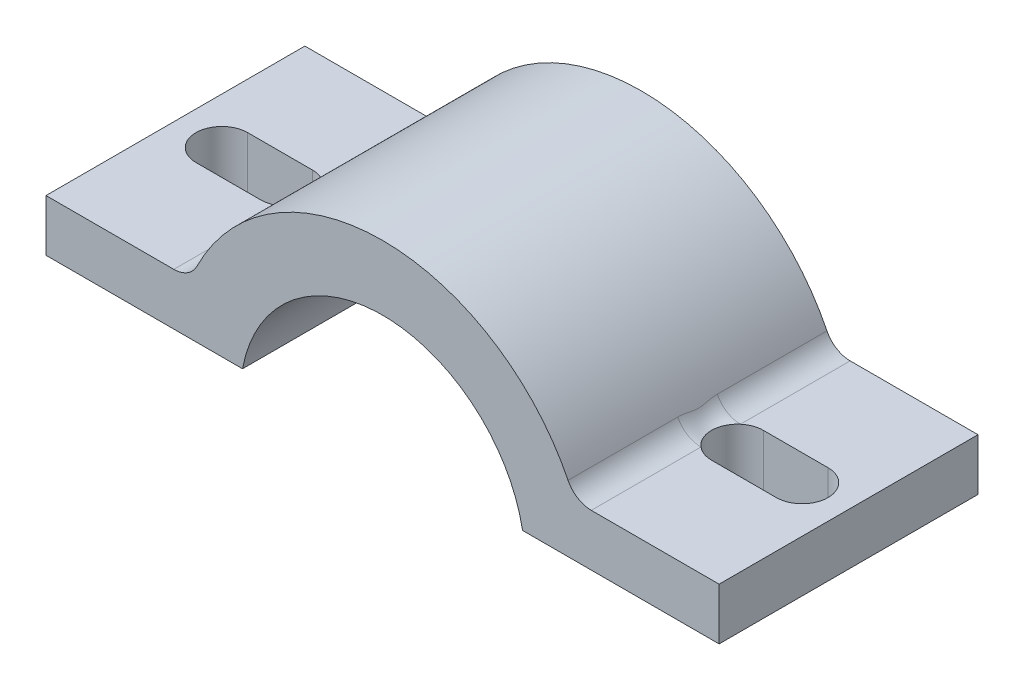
ISO-10303-21;
HEADER;
FILE_DESCRIPTION(('STEP AP214'),'2;1');
FILE_NAME('part.step','',(''),(''),'','','');
FILE_SCHEMA(('AUTOMOTIVE_DESIGN { 1 0 10303 214 1 1 1 1 }'));
ENDSEC;
DATA;
#1=APPLICATION_CONTEXT('core data for automotive mechanical design processes');
#2=APPLICATION_PROTOCOL_DEFINITION('international standard','automotive_design',2000,#1);
#3=PRODUCT_CONTEXT('',#1,'mechanical');
#4=PRODUCT('Part','Part','',(#3));
#5=PRODUCT_RELATED_PRODUCT_CATEGORY('part','',(#4));
#6=PRODUCT_DEFINITION_FORMATION('','',#4);
#7=PRODUCT_DEFINITION_CONTEXT('part definition',#1,'design');
#8=PRODUCT_DEFINITION('design','',#6,#7);
#9=PRODUCT_DEFINITION_SHAPE('','',#8);
#10=(LENGTH_UNIT() NAMED_UNIT(*) SI_UNIT(.MILLI.,.METRE.));
#11=(NAMED_UNIT(*) PLANE_ANGLE_UNIT() SI_UNIT($,.RADIAN.));
#12=(NAMED_UNIT(*) SI_UNIT($,.STERADIAN.) SOLID_ANGLE_UNIT());
#13=UNCERTAINTY_MEASURE_WITH_UNIT(LENGTH_MEASURE(1.E-05),#10,'distance_accuracy_value','');
#14=(GEOMETRIC_REPRESENTATION_CONTEXT(3) GLOBAL_UNCERTAINTY_ASSIGNED_CONTEXT((#13)) GLOBAL_UNIT_ASSIGNED_CONTEXT((#10,
#11,#12)) REPRESENTATION_CONTEXT('',''));
#15=CARTESIAN_POINT('',(0.,0.,0.));
#16=DIRECTION('',(0.,0.,1.));
#17=DIRECTION('',(1.,0.,0.));
#18=AXIS2_PLACEMENT_3D('',#15,#16,#17);
#19=CARTESIAN_POINT('',(0.,6.,20.));
#20=DIRECTION('',(0.,1.,0.));
#21=DIRECTION('',(0.,0.,1.));
#22=AXIS2_PLACEMENT_3D('',#19,#20,#21);
#23=PLANE('',#22);
#24=DIRECTION('',(1.,0.,0.));
#25=VECTOR('',#24,1.);
#26=CARTESIAN_POINT('',(0.,6.,20.));
#27=LINE('',#26,#25);
#28=CARTESIAN_POINT('',(-26.,6.,20.));
#29=VERTEX_POINT('',#28);
#30=CARTESIAN_POINT('',(-16.1245154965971,6.,20.));
#31=VERTEX_POINT('',#30);
#32=EDGE_CURVE('E621',#29,#31,#27,.T.);
#33=ORIENTED_EDGE('',*,*,#32,.T.);
#34=DIRECTION('',(0.,0.,-1.));
#35=VECTOR('',#34,1.);
#36=CARTESIAN_POINT('',(-16.1245154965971,6.,20.));
#37=LINE('',#36,#35);
#38=CARTESIAN_POINT('',(-16.1245154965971,6.,11.5269430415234));
#39=VERTEX_POINT('',#38);
#40=EDGE_CURVE('E237',#31,#39,#37,.T.);
#41=ORIENTED_EDGE('',*,*,#40,.T.);
#42=CARTESIAN_POINT('',(-17.4161984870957,6.,10.));
#43=DIRECTION('',(0.,1.,0.));
#44=DIRECTION('',(0.,0.,1.));
#45=AXIS2_PLACEMENT_3D('',#42,#43,#44);
#46=CIRCLE('',#45,2.);
#47=CARTESIAN_POINT('',(-17.4161984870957,6.,12.));
#48=VERTEX_POINT('',#47);
#49=EDGE_CURVE('E637',#39,#48,#46,.F.);
#50=ORIENTED_EDGE('',*,*,#49,.T.);
#51=DIRECTION('',(-1.,0.,0.));
#52=VECTOR('',#51,1.);
#53=CARTESIAN_POINT('',(0.,6.,12.));
#54=LINE('',#53,#52);
#55=CARTESIAN_POINT('',(-22.4161984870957,6.,12.));
#56=VERTEX_POINT('',#55);
#57=EDGE_CURVE('E645',#48,#56,#54,.T.);
#58=ORIENTED_EDGE('',*,*,#57,.T.);
#59=CARTESIAN_POINT('',(-22.4161984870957,6.,10.));
#60=DIRECTION('',(0.,1.,0.));
#61=DIRECTION('',(0.,0.,1.));
#62=AXIS2_PLACEMENT_3D('',#59,#60,#61);
#63=CIRCLE('',#62,2.);
#64=CARTESIAN_POINT('',(-22.4161984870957,6.,8.));
#65=VERTEX_POINT('',#64);
#66=EDGE_CURVE('E606',#56,#65,#63,.F.);
#67=ORIENTED_EDGE('',*,*,#66,.T.);
#68=DIRECTION('',(-1.,0.,0.));
#69=VECTOR('',#68,1.);
#70=CARTESIAN_POINT('',(0.,6.,8.00000000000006));
#71=LINE('',#70,#69);
#72=CARTESIAN_POINT('',(-17.4161984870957,6.,8.));
#73=VERTEX_POINT('',#72);
#74=EDGE_CURVE('E650',#73,#65,#71,.T.);
#75=ORIENTED_EDGE('',*,*,#74,.F.);
#76=CARTESIAN_POINT('',(-16.1245154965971,6.,8.47305695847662));
#77=VERTEX_POINT('',#76);
#78=EDGE_CURVE('E647',#73,#77,#46,.F.);
#79=ORIENTED_EDGE('',*,*,#78,.T.);
#80=DIRECTION('',(0.,0.,-1.));
#81=VECTOR('',#80,1.);
#82=CARTESIAN_POINT('',(-16.1245154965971,6.,20.));
#83=LINE('',#82,#81);
#84=CARTESIAN_POINT('',(-16.1245154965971,6.,0.));
#85=VERTEX_POINT('',#84);
#86=EDGE_CURVE('E235',#77,#85,#83,.T.);
#87=ORIENTED_EDGE('',*,*,#86,.T.);
#88=DIRECTION('',(1.,0.,0.));
#89=VECTOR('',#88,1.);
#90=CARTESIAN_POINT('',(0.,6.,0.));
#91=LINE('',#90,#89);
#92=CARTESIAN_POINT('',(-26.,6.,0.));
#93=VERTEX_POINT('',#92);
#94=EDGE_CURVE('E223',#93,#85,#91,.T.);
#95=ORIENTED_EDGE('',*,*,#94,.F.);
#96=DIRECTION('',(0.,0.,-1.));
#97=VECTOR('',#96,1.);
#98=CARTESIAN_POINT('',(-26.,6.,20.));
#99=LINE('',#98,#97);
#100=EDGE_CURVE('E229',#29,#93,#99,.T.);
#101=ORIENTED_EDGE('',*,*,#100,.F.);
#102=EDGE_LOOP('',(#33,#41,#50,#58,#67,#75,#79,#87,#95,#101));
#103=FACE_BOUND('',#102,.T.);
#104=ADVANCED_FACE('F43',(#103),#23,.T.);
#105=CARTESIAN_POINT('',(0.,0.,20.));
#106=DIRECTION('',(0.,0.,-1.));
#107=DIRECTION('',(-1.,0.,0.));
#108=AXIS2_PLACEMENT_3D('',#105,#106,#107);
#109=CYLINDRICAL_SURFACE('',#108,11.);
#110=DIRECTION('',(0.,0.,-1.));
#111=VECTOR('',#110,1.);
#112=CARTESIAN_POINT('',(10.816653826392,2.,20.));
#113=LINE('',#112,#111);
#114=CARTESIAN_POINT('',(10.816653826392,2.,20.));
#115=VERTEX_POINT('',#114);
#116=CARTESIAN_POINT('',(10.816653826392,2.,0.));
#117=VERTEX_POINT('',#116);
#118=EDGE_CURVE('E58',#115,#117,#113,.T.);
#119=ORIENTED_EDGE('',*,*,#118,.F.);
#120=CARTESIAN_POINT('',(0.,0.,20.));
#121=DIRECTION('',(0.,0.,1.));
#122=DIRECTION('',(1.,0.,0.));
#123=AXIS2_PLACEMENT_3D('',#120,#121,#122);
#124=CIRCLE('',#123,11.);
#125=CARTESIAN_POINT('',(-10.816653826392,2.,20.));
#126=VERTEX_POINT('',#125);
#127=EDGE_CURVE('E228',#115,#126,#124,.T.);
#128=ORIENTED_EDGE('',*,*,#127,.T.);
#129=DIRECTION('',(0.,0.,-1.));
#130=VECTOR('',#129,1.);
#131=CARTESIAN_POINT('',(-10.816653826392,2.,20.));
#132=LINE('',#131,#130);
#133=CARTESIAN_POINT('',(-10.816653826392,2.,0.));
#134=VERTEX_POINT('',#133);
#135=EDGE_CURVE('E669',#134,#126,#132,.F.);
#136=ORIENTED_EDGE('',*,*,#135,.F.);
#137=CARTESIAN_POINT('',(0.,0.,0.));
#138=DIRECTION('',(0.,0.,1.));
#139=DIRECTION('',(1.,0.,0.));
#140=AXIS2_PLACEMENT_3D('',#137,#138,#139);
#141=CIRCLE('',#140,11.);
#142=EDGE_CURVE('E213',#117,#134,#141,.T.);
#143=ORIENTED_EDGE('',*,*,#142,.F.);
#144=EDGE_LOOP('',(#119,#128,#136,#143));
#145=FACE_BOUND('',#144,.T.);
#146=ADVANCED_FACE('F260',(#145),#109,.F.);
#147=CARTESIAN_POINT('',(26.,0.,20.));
#148=DIRECTION('',(-1.,0.,0.));
#149=DIRECTION('',(0.,0.,1.));
#150=AXIS2_PLACEMENT_3D('',#147,#148,#149);
#151=PLANE('',#150);
#152=DIRECTION('',(0.,1.,0.));
#153=VECTOR('',#152,1.);
#154=CARTESIAN_POINT('',(26.,0.,20.));
#155=LINE('',#154,#153);
#156=CARTESIAN_POINT('',(26.,2.,20.));
#157=VERTEX_POINT('',#156);
#158=CARTESIAN_POINT('',(26.,6.,20.));
#159=VERTEX_POINT('',#158);
#160=EDGE_CURVE('E207',#157,#159,#155,.T.);
#161=ORIENTED_EDGE('',*,*,#160,.F.);
#162=DIRECTION('',(0.,0.,1.));
#163=VECTOR('',#162,1.);
#164=CARTESIAN_POINT('',(26.,2.,0.));
#165=LINE('',#164,#163);
#166=CARTESIAN_POINT('',(26.,2.,0.));
#167=VERTEX_POINT('',#166);
#168=EDGE_CURVE('E193',#167,#157,#165,.T.);
#169=ORIENTED_EDGE('',*,*,#168,.F.);
#170=DIRECTION('',(0.,1.,0.));
#171=VECTOR('',#170,1.);
#172=CARTESIAN_POINT('',(26.,0.,0.));
#173=LINE('',#172,#171);
#174=CARTESIAN_POINT('',(26.,6.,0.));
#175=VERTEX_POINT('',#174);
#176=EDGE_CURVE('E205',#167,#175,#173,.T.);
#177=ORIENTED_EDGE('',*,*,#176,.T.);
#178=DIRECTION('',(0.,0.,-1.));
#179=VECTOR('',#178,1.);
#180=CARTESIAN_POINT('',(26.,6.,20.));
#181=LINE('',#180,#179);
#182=EDGE_CURVE('E232',#159,#175,#181,.T.);
#183=ORIENTED_EDGE('',*,*,#182,.F.);
#184=EDGE_LOOP('',(#161,#169,#177,#183));
#185=FACE_BOUND('',#184,.T.);
#186=ADVANCED_FACE('F203',(#185),#151,.F.);
#187=CARTESIAN_POINT('',(0.,6.,20.));
#188=DIRECTION('',(0.,-1.,0.));
#189=DIRECTION('',(1.,0.,0.));
#190=AXIS2_PLACEMENT_3D('',#187,#188,#189);
#191=PLANE('',#190);
#192=DIRECTION('',(-1.,0.,0.));
#193=VECTOR('',#192,1.);
#194=CARTESIAN_POINT('',(0.,6.,0.));
#195=LINE('',#194,#193);
#196=CARTESIAN_POINT('',(16.1245154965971,6.,0.));
#197=VERTEX_POINT('',#196);
#198=EDGE_CURVE('E212',#175,#197,#195,.T.);
#199=ORIENTED_EDGE('',*,*,#198,.T.);
#200=DIRECTION('',(0.,0.,1.));
#201=VECTOR('',#200,1.);
#202=CARTESIAN_POINT('',(16.1245154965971,6.,20.));
#203=LINE('',#202,#201);
#204=CARTESIAN_POINT('',(16.1245154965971,6.,8.47305695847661));
#205=VERTEX_POINT('',#204);
#206=EDGE_CURVE('E557',#197,#205,#203,.T.);
#207=ORIENTED_EDGE('',*,*,#206,.T.);
#208=CARTESIAN_POINT('',(17.4161984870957,6.,10.));
#209=DIRECTION('',(0.,1.,0.));
#210=DIRECTION('',(0.,0.,1.));
#211=AXIS2_PLACEMENT_3D('',#208,#209,#210);
#212=CIRCLE('',#211,2.);
#213=CARTESIAN_POINT('',(17.4161984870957,6.,8.));
#214=VERTEX_POINT('',#213);
#215=EDGE_CURVE('E586',#214,#205,#212,.T.);
#216=ORIENTED_EDGE('',*,*,#215,.F.);
#217=DIRECTION('',(1.,0.,0.));
#218=VECTOR('',#217,1.);
#219=CARTESIAN_POINT('',(0.,6.,8.00000000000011));
#220=LINE('',#219,#218);
#221=CARTESIAN_POINT('',(22.4161984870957,6.,8.));
#222=VERTEX_POINT('',#221);
#223=EDGE_CURVE('E598',#214,#222,#220,.T.);
#224=ORIENTED_EDGE('',*,*,#223,.T.);
#225=CARTESIAN_POINT('',(22.4161984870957,6.,10.));
#226=DIRECTION('',(0.,1.,0.));
#227=DIRECTION('',(0.,0.,1.));
#228=AXIS2_PLACEMENT_3D('',#225,#226,#227);
#229=CIRCLE('',#228,2.);
#230=CARTESIAN_POINT('',(22.4161984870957,6.,12.));
#231=VERTEX_POINT('',#230);
#232=EDGE_CURVE('E594',#231,#222,#229,.T.);
#233=ORIENTED_EDGE('',*,*,#232,.F.);
#234=DIRECTION('',(1.,0.,0.));
#235=VECTOR('',#234,1.);
#236=CARTESIAN_POINT('',(0.,6.,12.));
#237=LINE('',#236,#235);
#238=CARTESIAN_POINT('',(17.4161984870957,6.,12.));
#239=VERTEX_POINT('',#238);
#240=EDGE_CURVE('E592',#239,#231,#237,.T.);
#241=ORIENTED_EDGE('',*,*,#240,.F.);
#242=CARTESIAN_POINT('',(16.1245154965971,6.,11.5269430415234));
#243=VERTEX_POINT('',#242);
#244=EDGE_CURVE('E579',#243,#239,#212,.T.);
#245=ORIENTED_EDGE('',*,*,#244,.F.);
#246=DIRECTION('',(0.,0.,1.));
#247=VECTOR('',#246,1.);
#248=CARTESIAN_POINT('',(16.1245154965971,6.,20.));
#249=LINE('',#248,#247);
#250=CARTESIAN_POINT('',(16.1245154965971,6.,20.));
#251=VERTEX_POINT('',#250);
#252=EDGE_CURVE('E566',#243,#251,#249,.T.);
#253=ORIENTED_EDGE('',*,*,#252,.T.);
#254=DIRECTION('',(-1.,0.,0.));
#255=VECTOR('',#254,1.);
#256=CARTESIAN_POINT('',(0.,6.,20.));
#257=LINE('',#256,#255);
#258=EDGE_CURVE('E615',#159,#251,#257,.T.);
#259=ORIENTED_EDGE('',*,*,#258,.F.);
#260=ORIENTED_EDGE('',*,*,#182,.T.);
#261=EDGE_LOOP('',(#199,#207,#216,#224,#233,#241,#245,#253,#259,#260));
#262=FACE_BOUND('',#261,.T.);
#263=ADVANCED_FACE('F524',(#262),#191,.F.);
#264=CARTESIAN_POINT('',(0.,0.,20.));
#265=DIRECTION('',(0.,0.,-1.));
#266=DIRECTION('',(-1.,0.,0.));
#267=AXIS2_PLACEMENT_3D('',#264,#265,#266);
#268=CYLINDRICAL_SURFACE('',#267,16.);
#269=CARTESIAN_POINT('',(0.,0.,0.));
#270=DIRECTION('',(0.,0.,1.));
#271=DIRECTION('',(1.,0.,0.));
#272=AXIS2_PLACEMENT_3D('',#269,#270,#271);
#273=CIRCLE('',#272,16.);
#274=CARTESIAN_POINT('',(14.3329026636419,7.11111111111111,0.));
#275=VERTEX_POINT('',#274);
#276=CARTESIAN_POINT('',(-14.3329026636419,7.11111111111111,0.));
#277=VERTEX_POINT('',#276);
#278=EDGE_CURVE('E215',#275,#277,#273,.T.);
#279=ORIENTED_EDGE('',*,*,#278,.T.);
#280=DIRECTION('',(0.,0.,-1.));
#281=VECTOR('',#280,1.);
#282=CARTESIAN_POINT('',(-14.3329026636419,7.11111111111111,20.));
#283=LINE('',#282,#281);
#284=CARTESIAN_POINT('',(-14.3329026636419,7.11111111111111,8.47305695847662));
#285=VERTEX_POINT('',#284);
#286=EDGE_CURVE('E570',#277,#285,#283,.F.);
#287=ORIENTED_EDGE('',*,*,#286,.T.);
#288=CARTESIAN_POINT('',(-16.3793248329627,6.,11.7102318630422));
#289=CARTESIAN_POINT('',(-14.970788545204,5.81553719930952,11.8038655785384));
#290=CARTESIAN_POINT('',(-14.3548202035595,7.06676283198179,12.0898475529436));
#291=CARTESIAN_POINT('',(-16.3505308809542,6.,11.6927226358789));
#292=CARTESIAN_POINT('',(-14.9602450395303,5.83943478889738,11.7767287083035));
#293=CARTESIAN_POINT('',(-14.3492488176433,7.07807425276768,12.0207697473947));
#294=CARTESIAN_POINT('',(-16.3207107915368,6.,11.6736954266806));
#295=CARTESIAN_POINT('',(-14.9494834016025,5.86318241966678,11.746954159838));
#296=CARTESIAN_POINT('',(-14.3447773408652,7.08712923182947,11.9511376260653));
#297=CARTESIAN_POINT('',(-16.2588784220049,6.,11.6315817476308));
#298=CARTESIAN_POINT('',(-14.9278451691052,5.90984866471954,11.6819335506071));
#299=CARTESIAN_POINT('',(-14.3379498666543,7.10093476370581,11.8111974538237));
#300=CARTESIAN_POINT('',(-16.2268660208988,6.,11.6084950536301));
#301=CARTESIAN_POINT('',(-14.9169734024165,5.93276793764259,11.6467546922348));
#302=CARTESIAN_POINT('',(-14.3355939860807,7.10568507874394,11.7408893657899));
#303=CARTESIAN_POINT('',(-16.1610203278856,6.,11.5576332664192));
#304=CARTESIAN_POINT('',(-14.89549517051,5.97716408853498,11.5711941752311));
#305=CARTESIAN_POINT('',(-14.33293448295,7.11104716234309,11.6011161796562));
#306=CARTESIAN_POINT('',(-16.127222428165,6.,11.5299353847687));
#307=CARTESIAN_POINT('',(-14.8848917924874,5.99865722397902,11.530978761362));
#308=CARTESIAN_POINT('',(-14.3325999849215,7.11172119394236,11.5316546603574));
#309=CARTESIAN_POINT('',(-16.0573721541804,6.,11.4682544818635));
#310=CARTESIAN_POINT('',(-14.86401120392,6.04030905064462,11.4445105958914));
#311=CARTESIAN_POINT('',(-14.3337375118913,7.1094283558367,11.3928939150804));
#312=CARTESIAN_POINT('',(-16.0213217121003,6.,11.4342767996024));
#313=CARTESIAN_POINT('',(-14.8537343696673,6.06047477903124,11.3983435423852));
#314=CARTESIAN_POINT('',(-14.3352080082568,7.10646456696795,11.3235946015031));
#315=CARTESIAN_POINT('',(-15.9565072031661,6.,11.3677983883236));
#316=CARTESIAN_POINT('',(-14.8362335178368,6.09438111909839,11.3116856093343));
#317=CARTESIAN_POINT('',(-14.3391402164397,7.09852597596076,11.2027723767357));
#318=CARTESIAN_POINT('',(-15.9281980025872,6.,11.3370856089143));
#319=CARTESIAN_POINT('',(-14.8289096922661,6.10843028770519,11.2728303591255));
#320=CARTESIAN_POINT('',(-14.3412584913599,7.09424670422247,11.1511732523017));
#321=CARTESIAN_POINT('',(-15.8706688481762,6.,11.2701533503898));
#322=CARTESIAN_POINT('',(-14.8146803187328,6.13551540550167,11.1910428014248));
#323=CARTESIAN_POINT('',(-14.346223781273,7.08420034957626,11.0482019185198));
#324=CARTESIAN_POINT('',(-15.8414488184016,6.,11.2339334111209));
#325=CARTESIAN_POINT('',(-14.8077722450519,6.14855790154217,11.1481479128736));
#326=CARTESIAN_POINT('',(-14.3490708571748,7.07843314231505,10.9968297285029));
#327=CARTESIAN_POINT('',(-15.7824868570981,6.,11.1547432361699));
#328=CARTESIAN_POINT('',(-14.7944777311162,6.17350830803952,11.0577565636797));
#329=CARTESIAN_POINT('',(-14.3553177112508,7.06575566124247,10.8941523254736));
#330=CARTESIAN_POINT('',(-15.7527436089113,6.,11.1117528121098));
#331=CARTESIAN_POINT('',(-14.7880883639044,6.18542250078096,11.0102815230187));
#332=CARTESIAN_POINT('',(-14.3587191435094,7.05884196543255,10.8428477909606));
#333=CARTESIAN_POINT('',(-15.6936740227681,6.,11.0178349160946));
#334=CARTESIAN_POINT('',(-14.7759982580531,6.20787002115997,10.9104118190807));
#335=CARTESIAN_POINT('',(-14.3658226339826,7.04437396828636,10.7403823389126));
#336=CARTESIAN_POINT('',(-15.664347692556,6.,10.9669072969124));
#337=CARTESIAN_POINT('',(-14.7702908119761,6.21841660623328,10.8580451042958));
#338=CARTESIAN_POINT('',(-14.3695246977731,7.03681965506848,10.6892214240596));
#339=CARTESIAN_POINT('',(-15.607800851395,6.,10.8564499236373));
#340=CARTESIAN_POINT('',(-14.7597880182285,6.23777065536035,10.7485657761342));
#341=CARTESIAN_POINT('',(-14.3768719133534,7.02179627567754,10.5873984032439));
#342=CARTESIAN_POINT('',(-15.580562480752,6.,10.7970096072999));
#343=CARTESIAN_POINT('',(-14.7549755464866,6.24661066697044,10.6915170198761));
#344=CARTESIAN_POINT('',(-14.3805172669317,7.0143271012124,10.5367363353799));
#345=CARTESIAN_POINT('',(-15.529951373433,6.,10.668454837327));
#346=CARTESIAN_POINT('',(-14.7463939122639,6.262350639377,10.5721417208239));
#347=CARTESIAN_POINT('',(-14.3873915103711,7.00021622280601,10.4352174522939));
#348=CARTESIAN_POINT('',(-15.5065790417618,6.,10.5993393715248));
#349=CARTESIAN_POINT('',(-14.7426136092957,6.26927120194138,10.5097861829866));
#350=CARTESIAN_POINT('',(-14.3906203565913,6.99357460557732,10.3843606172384));
#351=CARTESIAN_POINT('',(-15.4665801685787,6.,10.4524611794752));
#352=CARTESIAN_POINT('',(-14.7363418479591,6.28074584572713,10.3807304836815));
#353=CARTESIAN_POINT('',(-14.3961804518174,6.98212212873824,10.2826142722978));
#354=CARTESIAN_POINT('',(-15.4499144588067,6.,10.3747521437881));
#355=CARTESIAN_POINT('',(-14.7338313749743,6.28533480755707,10.3139751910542));
#356=CARTESIAN_POINT('',(-14.3985169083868,6.97730064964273,10.2317267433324));
#357=CARTESIAN_POINT('',(-15.4259310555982,6.,10.2132109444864));
#358=CARTESIAN_POINT('',(-14.730273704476,6.29183709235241,10.1774465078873));
#359=CARTESIAN_POINT('',(-14.4018846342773,6.97034685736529,10.1296723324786));
#360=CARTESIAN_POINT('',(-15.4186081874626,6.,10.1293821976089));
#361=CARTESIAN_POINT('',(-14.7292171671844,6.29376748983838,10.1075244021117));
#362=CARTESIAN_POINT('',(-14.4029166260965,6.96821305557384,10.0785056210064));
#363=CARTESIAN_POINT('',(-15.4149625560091,6.,9.96776174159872));
#364=CARTESIAN_POINT('',(-14.7286898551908,6.29473097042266,9.97321151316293));
#365=CARTESIAN_POINT('',(-14.4034301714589,6.9671514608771,9.98041185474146));
#366=CARTESIAN_POINT('',(-15.417768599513,6.,9.89005347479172));
#367=CARTESIAN_POINT('',(-14.7290922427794,6.29399579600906,9.90869928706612));
#368=CARTESIAN_POINT('',(-14.403034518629,6.96796975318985,9.93348919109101));
#369=CARTESIAN_POINT('',(-15.4319537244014,6.,9.73805589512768));
#370=CARTESIAN_POINT('',(-14.7311647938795,6.29020851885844,9.78156619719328));
#371=CARTESIAN_POINT('',(-14.4010387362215,6.97209351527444,9.83980851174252));
#372=CARTESIAN_POINT('',(-15.4433359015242,6.,9.66376782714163));
#373=CARTESIAN_POINT('',(-14.7328398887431,6.28714740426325,9.71881298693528));
#374=CARTESIAN_POINT('',(-14.3994381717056,6.97539988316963,9.79305056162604));
#375=CARTESIAN_POINT('',(-15.472943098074,6.,9.52135770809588));
#376=CARTESIAN_POINT('',(-14.7373337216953,6.27893113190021,9.59649792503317));
#377=CARTESIAN_POINT('',(-14.3952959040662,6.98394428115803,9.69957820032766));
#378=CARTESIAN_POINT('',(-15.4912037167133,6.,9.45327006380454));
#379=CARTESIAN_POINT('',(-14.7401665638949,6.27375015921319,9.53686243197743));
#380=CARTESIAN_POINT('',(-14.3927493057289,6.98919235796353,9.65286530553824));
#381=CARTESIAN_POINT('',(-15.5323194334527,6.,9.32505887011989));
#382=CARTESIAN_POINT('',(-14.7468015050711,6.26160170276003,9.42190316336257));
#383=CARTESIAN_POINT('',(-14.3870748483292,7.00086559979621,9.55967928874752));
#384=CARTESIAN_POINT('',(-15.5551747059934,6.,9.26493562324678));
#385=CARTESIAN_POINT('',(-14.7506127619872,6.254617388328,9.36653257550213));
#386=CARTESIAN_POINT('',(-14.3839469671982,7.00729080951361,9.51320617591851));
#387=CARTESIAN_POINT('',(-15.6037873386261,6.,9.15206836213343));
#388=CARTESIAN_POINT('',(-14.7590840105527,6.23906141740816,9.25966271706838));
#389=CARTESIAN_POINT('',(-14.3774167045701,7.02067981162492,9.41986848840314));
#390=CARTESIAN_POINT('',(-15.6295733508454,6.,9.09941096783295));
#391=CARTESIAN_POINT('',(-14.7637608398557,6.23045834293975,9.20820350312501));
#392=CARTESIAN_POINT('',(-14.3740117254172,7.02764866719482,9.37300510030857));
#393=CARTESIAN_POINT('',(-15.6823580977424,6.,9.00155704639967));
#394=CARTESIAN_POINT('',(-14.7737869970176,6.21195511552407,9.10963724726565));
#395=CARTESIAN_POINT('',(-14.36725295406,7.04145594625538,9.27925199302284));
#396=CARTESIAN_POINT('',(-15.709356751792,6.,8.95636002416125));
#397=CARTESIAN_POINT('',(-14.7791429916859,6.20204227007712,9.06254082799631));
#398=CARTESIAN_POINT('',(-14.3638991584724,7.04829437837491,9.23236227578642));
#399=CARTESIAN_POINT('',(-15.7635132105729,6.,8.87256230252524));
#400=CARTESIAN_POINT('',(-14.7903905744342,6.18112989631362,8.97248021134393));
#401=CARTESIAN_POINT('',(-14.3574853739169,7.06135021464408,9.13855777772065));
#402=CARTESIAN_POINT('',(-15.7906704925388,6.,8.83394635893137));
#403=CARTESIAN_POINT('',(-14.7962858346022,6.1701230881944,8.92952853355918));
#404=CARTESIAN_POINT('',(-14.3544247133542,7.06756903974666,9.09164331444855));
#405=CARTESIAN_POINT('',(-15.8445958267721,6.,8.76223260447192));
#406=CARTESIAN_POINT('',(-14.808518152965,6.14714793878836,8.84730366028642));
#407=CARTESIAN_POINT('',(-14.3487694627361,7.07904342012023,8.99763124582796));
#408=CARTESIAN_POINT('',(-15.8713638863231,6.,8.72913469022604));
#409=CARTESIAN_POINT('',(-14.8148584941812,6.13517244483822,8.80805817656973));
#410=CARTESIAN_POINT('',(-14.3461748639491,7.08429899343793,8.95053364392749));
#411=CARTESIAN_POINT('',(-15.9502071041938,6.,8.63712362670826));
#412=CARTESIAN_POINT('',(-14.8344007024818,6.09798563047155,8.69536816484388));
#413=CARTESIAN_POINT('',(-14.3393379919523,7.09813311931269,8.8094705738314));
#414=CARTESIAN_POINT('',(-16.0011441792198,6.,8.5850305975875));
#415=CARTESIAN_POINT('',(-14.8480581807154,6.07163488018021,8.62746443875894));
#416=CARTESIAN_POINT('',(-14.3360020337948,7.10486150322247,8.71519381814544));
#417=CARTESIAN_POINT('',(-16.0988257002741,6.,8.49369534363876));
#418=CARTESIAN_POINT('',(-14.8761296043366,6.01632886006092,8.50292697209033));
#419=CARTESIAN_POINT('',(-14.3325391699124,7.11184505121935,8.52618592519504));
#420=CARTESIAN_POINT('',(-16.1455681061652,6.,8.45445934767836));
#421=CARTESIAN_POINT('',(-14.8905450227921,5.98735355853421,8.44651156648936));
#422=CARTESIAN_POINT('',(-14.3324138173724,7.11209708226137,8.43145459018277));
#423=CARTESIAN_POINT('',(-16.2356962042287,6.,8.38453612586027));
#424=CARTESIAN_POINT('',(-14.91986421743,5.92683320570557,8.34279675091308));
#425=CARTESIAN_POINT('',(-14.3358532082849,7.10516235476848,8.24058353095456));
#426=CARTESIAN_POINT('',(-16.2790022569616,6.,8.35402350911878));
#427=CARTESIAN_POINT('',(-14.9347607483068,5.89524975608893,8.29589343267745));
#428=CARTESIAN_POINT('',(-14.3394873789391,7.09783563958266,8.14445081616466));
#429=CARTESIAN_POINT('',(-16.3409730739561,6.,8.31343765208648));
#430=CARTESIAN_POINT('',(-14.9567870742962,5.84699504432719,8.23302893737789));
#431=CARTESIAN_POINT('',(-14.3479526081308,7.08069863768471,8.00134676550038));
#432=CARTESIAN_POINT('',(-16.3611523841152,6.,8.30076186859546));
#433=CARTESIAN_POINT('',(-14.964120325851,5.83065981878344,8.21322490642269));
#434=CARTESIAN_POINT('',(-14.3512819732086,7.07395106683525,7.95377652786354));
#435=CARTESIAN_POINT('',(-16.400566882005,6.,8.27691526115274));
#436=CARTESIAN_POINT('',(-14.9786380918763,5.79773675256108,8.17601168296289));
#437=CARTESIAN_POINT('',(-14.3589534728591,7.05836582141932,7.8591636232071));
#438=CARTESIAN_POINT('',(-16.4198018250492,6.,8.26574482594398));
#439=CARTESIAN_POINT('',(-14.9858204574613,5.78114944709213,8.15862280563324));
#440=CARTESIAN_POINT('',(-14.3632958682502,7.04952760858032,7.81212109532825));
#441=CARTESIAN_POINT('',(-16.4385951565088,6.,8.2552101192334));
#442=CARTESIAN_POINT('',(-14.9928703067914,5.76454330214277,8.14245222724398));
#443=CARTESIAN_POINT('',(-14.3681468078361,7.03962763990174,7.76541771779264));
#444=(BOUNDED_SURFACE() B_SPLINE_SURFACE(3,2,((#288,#289,#290),(#291,#292,#293),(#294,#295,
#296),(#297,#298,#299),(#300,#301,#302),(#303,#304,#305),(#306,#307,#308),(#309,#310,#311),
(#312,#313,#314),(#315,#316,#317),(#318,#319,#320),(#321,#322,#323),(#324,#325,#326),(#327,#328,
#329),(#330,#331,#332),(#333,#334,#335),(#336,#337,#338),(#339,#340,#341),(#342,#343,#344),
(#345,#346,#347),(#348,#349,#350),(#351,#352,#353),(#354,#355,#356),(#357,#358,#359),(#360,#361,
#362),(#363,#364,#365),(#366,#367,#368),(#369,#370,#371),(#372,#373,#374),(#375,#376,#377),
(#378,#379,#380),(#381,#382,#383),(#384,#385,#386),(#387,#388,#389),(#390,#391,#392),(#393,#394,
#395),(#396,#397,#398),(#399,#400,#401),(#402,#403,#404),(#405,#406,#407),(#408,#409,#410),
(#411,#412,#413),(#414,#415,#416),(#417,#418,#419),(#420,#421,#422),(#423,#424,#425),(#426,#427,
#428),(#429,#430,#431),(#432,#433,#434),(#435,#436,#437),(#438,#439,#440),(#441,#442,#443)),
.UNSPECIFIED.,.F.,.F.,.F.) B_SPLINE_SURFACE_WITH_KNOTS((4,2,2,2,2,2,2,2,2,2,2,2,2,2,2,2,2,2,2,2,
2,2,2,2,2,4),(3,3),(0.,0.211463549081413,0.422938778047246,0.631175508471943,0.839236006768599,
0.994833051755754,1.15044310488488,1.30652626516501,1.46261232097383,1.61716473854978,
1.77173333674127,1.92538563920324,2.07895280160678,2.21963832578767,2.36037465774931,
2.50184960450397,2.64332992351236,2.78633678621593,2.92933415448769,3.07199564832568,
3.21465446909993,3.4983223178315,3.78212739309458,4.07126870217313,4.21615641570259,
4.36108147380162),(0.,1.),
.UNSPECIFIED.) GEOMETRIC_REPRESENTATION_ITEM() RATIONAL_B_SPLINE_SURFACE(((1.,0.814681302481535,
1.),(1.,0.818869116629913,1.),(1.,0.823118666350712,1.),(1.,0.831759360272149,1.),(1.,
0.83615051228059,1.),(1.,0.845023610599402,1.),(1.,0.849503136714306,1.),(1.,0.858619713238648,
1.),(1.,0.863256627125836,1.),(1.,0.871483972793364,1.),(1.,0.875043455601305,1.),(1.,
0.882214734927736,1.),(1.,0.885826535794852,1.),(1.,0.893060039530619,1.),(1.,0.896681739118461,
1.),(1.,0.903828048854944,1.),(1.,0.907352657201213,1.),(1.,0.914112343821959,1.),(1.,
0.917349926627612,1.),(1.,0.923340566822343,1.),(1.,0.92609357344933,1.),(1.,0.93079173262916,
1.),(1.,0.932741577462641,1.),(1.,0.935544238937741,1.),(1.,0.936397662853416,1.),(1.,
0.936822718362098,1.),(1.,0.936495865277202,1.),(1.,0.934840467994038,1.),(1.,0.933511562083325,
1.),(1.,0.930044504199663,1.),(1.,0.927902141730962,1.),(1.,0.923059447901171,1.),(1.,
0.920359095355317,1.),(1.,0.914588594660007,1.),(1.,0.911514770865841,1.),(1.,0.905188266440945,
1.),(1.,0.901935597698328,1.),(1.,0.895370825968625,1.),(1.,0.892058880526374,1.),(1.,
0.88543698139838,1.),(1.,0.882127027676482,1.),(1.,0.872301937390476,1.),(1.,0.865852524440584,
1.),(1.,0.853250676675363,1.),(1.,0.847098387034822,1.),(1.,0.834967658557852,1.),(1.,
0.828994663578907,1.),(1.,0.820222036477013,1.),(1.,0.817325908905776,1.),(1.,0.811590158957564,
1.),(1.,0.808750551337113,1.),(1.,0.805935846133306,1.))) REPRESENTATION_ITEM('') SURFACE());
#445=CARTESIAN_POINT('',(-14.3681468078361,7.03962763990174,7.76541771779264));
#446=CARTESIAN_POINT('',(-14.3632958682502,7.04952760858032,7.81212109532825));
#447=CARTESIAN_POINT('',(-14.3589534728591,7.05836582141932,7.8591636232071));
#448=CARTESIAN_POINT('',(-14.3512819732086,7.07395106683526,7.95377652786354));
#449=CARTESIAN_POINT('',(-14.3479526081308,7.08069863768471,8.00134676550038));
#450=CARTESIAN_POINT('',(-14.3394873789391,7.09783563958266,8.14445081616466));
#451=CARTESIAN_POINT('',(-14.3358532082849,7.10516235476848,8.24058353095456));
#452=CARTESIAN_POINT('',(-14.3324138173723,7.11209708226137,8.43145459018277));
#453=CARTESIAN_POINT('',(-14.3325391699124,7.11184505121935,8.52618592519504));
#454=CARTESIAN_POINT('',(-14.3360020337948,7.10486150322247,8.71519381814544));
#455=CARTESIAN_POINT('',(-14.3393379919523,7.09813311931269,8.8094705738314));
#456=CARTESIAN_POINT('',(-14.3461748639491,7.08429899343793,8.95053364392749));
#457=CARTESIAN_POINT('',(-14.3487694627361,7.07904342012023,8.99763124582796));
#458=CARTESIAN_POINT('',(-14.3544247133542,7.06756903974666,9.09164331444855));
#459=CARTESIAN_POINT('',(-14.3574853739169,7.06135021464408,9.13855777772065));
#460=CARTESIAN_POINT('',(-14.3638991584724,7.04829437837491,9.23236227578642));
#461=CARTESIAN_POINT('',(-14.36725295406,7.04145594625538,9.27925199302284));
#462=CARTESIAN_POINT('',(-14.3740117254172,7.02764866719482,9.37300510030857));
#463=CARTESIAN_POINT('',(-14.3774167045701,7.02067981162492,9.41986848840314));
#464=CARTESIAN_POINT('',(-14.3839469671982,7.00729080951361,9.51320617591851));
#465=CARTESIAN_POINT('',(-14.3870748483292,7.00086559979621,9.55967928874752));
#466=CARTESIAN_POINT('',(-14.3927493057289,6.98919235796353,9.65286530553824));
#467=CARTESIAN_POINT('',(-14.3952959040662,6.98394428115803,9.69957820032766));
#468=CARTESIAN_POINT('',(-14.3994381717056,6.97539988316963,9.79305056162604));
#469=CARTESIAN_POINT('',(-14.4010387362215,6.97209351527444,9.83980851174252));
#470=CARTESIAN_POINT('',(-14.403034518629,6.96796975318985,9.93348919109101));
#471=CARTESIAN_POINT('',(-14.4034301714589,6.9671514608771,9.98041185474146));
#472=CARTESIAN_POINT('',(-14.4029166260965,6.96821305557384,10.0785056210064));
#473=CARTESIAN_POINT('',(-14.4018846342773,6.97034685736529,10.1296723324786));
#474=CARTESIAN_POINT('',(-14.3985169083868,6.97730064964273,10.2317267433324));
#475=CARTESIAN_POINT('',(-14.3961804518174,6.98212212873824,10.2826142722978));
#476=CARTESIAN_POINT('',(-14.3906203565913,6.99357460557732,10.3843606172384));
#477=CARTESIAN_POINT('',(-14.3873915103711,7.00021622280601,10.4352174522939));
#478=CARTESIAN_POINT('',(-14.3805172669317,7.0143271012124,10.5367363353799));
#479=CARTESIAN_POINT('',(-14.3768719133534,7.02179627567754,10.5873984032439));
#480=CARTESIAN_POINT('',(-14.3695246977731,7.03681965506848,10.6892214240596));
#481=CARTESIAN_POINT('',(-14.3658226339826,7.04437396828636,10.7403823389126));
#482=CARTESIAN_POINT('',(-14.3587191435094,7.05884196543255,10.8428477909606));
#483=CARTESIAN_POINT('',(-14.3553177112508,7.06575566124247,10.8941523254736));
#484=CARTESIAN_POINT('',(-14.3490708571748,7.07843314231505,10.9968297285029));
#485=CARTESIAN_POINT('',(-14.346223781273,7.08420034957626,11.0482019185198));
#486=CARTESIAN_POINT('',(-14.3412584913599,7.09424670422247,11.1511732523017));
#487=CARTESIAN_POINT('',(-14.3391402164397,7.09852597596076,11.2027723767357));
#488=CARTESIAN_POINT('',(-14.3352080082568,7.10646456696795,11.3235946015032));
#489=CARTESIAN_POINT('',(-14.3337375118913,7.1094283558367,11.3928939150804));
#490=CARTESIAN_POINT('',(-14.3325999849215,7.11172119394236,11.5316546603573));
#491=CARTESIAN_POINT('',(-14.33293448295,7.11104716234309,11.6011161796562));
#492=CARTESIAN_POINT('',(-14.3355939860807,7.10568507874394,11.7408893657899));
#493=CARTESIAN_POINT('',(-14.3379498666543,7.10093476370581,11.8111974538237));
#494=CARTESIAN_POINT('',(-14.3447773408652,7.08712923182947,11.9511376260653));
#495=CARTESIAN_POINT('',(-14.3492488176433,7.07807425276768,12.0207697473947));
#496=CARTESIAN_POINT('',(-14.3548202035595,7.06676283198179,12.0898475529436));
#497=B_SPLINE_CURVE_WITH_KNOTS('',3,(#445,#446,#447,#448,#449,#450,#451,#452,#453,#454,#455,
#456,#457,#458,#459,#460,#461,#462,#463,#464,#465,#466,#467,#468,#469,#470,#471,#472,#473,#474,
#475,#476,#477,#478,#479,#480,#481,#482,#483,#484,#485,#486,#487,#488,#489,#490,#491,#492,#493,
#494,#495,#496),.UNSPECIFIED.,.F.,.F.,(4,2,2,2,2,2,2,2,2,2,2,2,2,2,2,2,2,2,2,2,2,2,2,2,2,4),(0.,
0.144925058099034,0.289812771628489,0.578954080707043,0.86275915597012,1.14642700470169,
1.28908582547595,1.43174731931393,1.5747446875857,1.71775155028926,1.85923186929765,
2.00070681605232,2.14144314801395,2.28212867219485,2.43569583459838,2.58934813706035,
2.74391673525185,2.8984691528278,3.05455520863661,3.21063836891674,3.36624842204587,
3.52184546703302,3.72990596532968,3.93814269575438,4.14961792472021,4.36108147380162),.UNSPECIFIED.);
#498=CARTESIAN_POINT('',(-14.3329026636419,7.11111111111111,11.5269430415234));
#499=VERTEX_POINT('',#498);
#500=EDGE_CURVE('E694',#285,#499,#497,.T.);
#501=ORIENTED_EDGE('',*,*,#500,.T.);
#502=DIRECTION('',(0.,0.,-1.));
#503=VECTOR('',#502,1.);
#504=CARTESIAN_POINT('',(-14.3329026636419,7.11111111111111,20.));
#505=LINE('',#504,#503);
#506=CARTESIAN_POINT('',(-14.3329026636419,7.11111111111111,20.));
#507=VERTEX_POINT('',#506);
#508=EDGE_CURVE('E632',#499,#507,#505,.F.);
#509=ORIENTED_EDGE('',*,*,#508,.T.);
#510=CARTESIAN_POINT('',(0.,0.,20.));
#511=DIRECTION('',(0.,0.,1.));
#512=DIRECTION('',(1.,0.,0.));
#513=AXIS2_PLACEMENT_3D('',#510,#511,#512);
#514=CIRCLE('',#513,16.);
#515=CARTESIAN_POINT('',(14.3329026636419,7.11111111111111,20.));
#516=VERTEX_POINT('',#515);
#517=EDGE_CURVE('E618',#516,#507,#514,.T.);
#518=ORIENTED_EDGE('',*,*,#517,.F.);
#519=DIRECTION('',(0.,0.,-1.));
#520=VECTOR('',#519,1.);
#521=CARTESIAN_POINT('',(14.3329026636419,7.11111111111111,20.));
#522=LINE('',#521,#520);
#523=CARTESIAN_POINT('',(14.3329026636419,7.11111111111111,11.5269430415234));
#524=VERTEX_POINT('',#523);
#525=EDGE_CURVE('E250',#516,#524,#522,.T.);
#526=ORIENTED_EDGE('',*,*,#525,.T.);
#527=CARTESIAN_POINT('',(14.3548202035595,7.06676283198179,12.0898475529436));
#528=CARTESIAN_POINT('',(14.9707885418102,5.81553720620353,11.803865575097));
#529=CARTESIAN_POINT('',(16.3793248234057,6.,11.7102318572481));
#530=CARTESIAN_POINT('',(14.3492488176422,7.07807425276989,12.0207697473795));
#531=CARTESIAN_POINT('',(14.9602450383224,5.8394347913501,11.7767287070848));
#532=CARTESIAN_POINT('',(16.3505308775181,6.,11.6927226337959));
#533=CARTESIAN_POINT('',(14.3447773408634,7.08712923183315,11.9511376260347));
#534=CARTESIAN_POINT('',(14.949483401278,5.86318242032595,11.7469541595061));
#535=CARTESIAN_POINT('',(16.3207107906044,6.,11.6736954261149));
#536=CARTESIAN_POINT('',(14.3379498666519,7.10093476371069,11.8111974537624));
#537=CARTESIAN_POINT('',(14.9278451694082,5.90984866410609,11.6819335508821));
#538=CARTESIAN_POINT('',(16.2588784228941,6.,11.631581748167));
#539=CARTESIAN_POINT('',(14.3355939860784,7.10568507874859,11.7408893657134));
#540=CARTESIAN_POINT('',(14.9169734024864,5.93276793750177,11.6467546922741));
#541=CARTESIAN_POINT('',(16.2268660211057,6.,11.6084950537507));
#542=CARTESIAN_POINT('',(14.3329344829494,7.11104716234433,11.6011161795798));
#543=CARTESIAN_POINT('',(14.8954951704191,5.97716408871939,11.5711941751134));
#544=CARTESIAN_POINT('',(16.1610203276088,6.,11.557633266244));
#545=CARTESIAN_POINT('',(14.3325999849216,7.11172119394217,11.5316546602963));
#546=CARTESIAN_POINT('',(14.8848917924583,5.99865722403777,11.5309787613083));
#547=CARTESIAN_POINT('',(16.1272224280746,6.,11.5299353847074));
#548=CARTESIAN_POINT('',(14.333737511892,7.10942835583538,11.3928939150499));
#549=CARTESIAN_POINT('',(14.8640112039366,6.04030905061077,11.4445105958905));
#550=CARTESIAN_POINT('',(16.0573721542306,6.,11.4682544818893));
#551=CARTESIAN_POINT('',(14.3352080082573,7.10646456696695,11.3235946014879));
#552=CARTESIAN_POINT('',(14.8537343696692,6.06047477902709,11.3983435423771));
#553=CARTESIAN_POINT('',(16.0213217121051,6.,11.4342767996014));
#554=CARTESIAN_POINT('',(14.3391402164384,7.09852597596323,11.2027723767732));
#555=CARTESIAN_POINT('',(14.8362335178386,6.09438111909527,11.3116856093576));
#556=CARTESIAN_POINT('',(15.9565072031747,6.,11.3677983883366));
#557=CARTESIAN_POINT('',(14.3412584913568,7.09424670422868,11.1511732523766));
#558=CARTESIAN_POINT('',(14.8289096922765,6.10843028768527,11.2728303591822));
#559=CARTESIAN_POINT('',(15.9281980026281,6.,11.3370856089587));
#560=CARTESIAN_POINT('',(14.3462237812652,7.08420034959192,11.0482019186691));
#561=CARTESIAN_POINT('',(14.8146803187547,6.13551540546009,11.1910428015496));
#562=CARTESIAN_POINT('',(15.8706688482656,6.,11.2701533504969));
#563=CARTESIAN_POINT('',(14.3490708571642,7.07843314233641,10.9968297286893));
#564=CARTESIAN_POINT('',(14.8077722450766,6.14855790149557,11.1481479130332));
#565=CARTESIAN_POINT('',(15.8414488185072,6.,11.2339334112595));
#566=CARTESIAN_POINT('',(14.3553177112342,7.06575566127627,10.894152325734));
#567=CARTESIAN_POINT('',(14.7944777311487,6.17350830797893,11.0577565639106));
#568=CARTESIAN_POINT('',(15.7824868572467,6.,11.1547432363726));
#569=CARTESIAN_POINT('',(14.3587191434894,7.05884196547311,10.8428477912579));
#570=CARTESIAN_POINT('',(14.7880883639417,6.18542250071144,11.0102815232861));
#571=CARTESIAN_POINT('',(15.7527436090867,6.,11.1117528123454));
#572=CARTESIAN_POINT('',(14.3658226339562,7.04437396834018,10.7403823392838));
#573=CARTESIAN_POINT('',(14.7759982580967,6.20787002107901,10.910411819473));
#574=CARTESIAN_POINT('',(15.6936740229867,6.,11.0178349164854));
#575=CARTESIAN_POINT('',(14.3695246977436,7.03681965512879,10.6892214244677));
#576=CARTESIAN_POINT('',(14.7702908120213,6.21841660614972,10.8580451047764));
#577=CARTESIAN_POINT('',(15.6643476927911,6.,10.9669072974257));
#578=CARTESIAN_POINT('',(14.3768719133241,7.02179627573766,10.5873984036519));
#579=CARTESIAN_POINT('',(14.7597880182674,6.23777065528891,10.7485657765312));
#580=CARTESIAN_POINT('',(15.6078008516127,6.,10.856449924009));
#581=CARTESIAN_POINT('',(14.3805172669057,7.01432710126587,10.536736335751));
#582=CARTESIAN_POINT('',(14.7549755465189,6.24661066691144,10.6915170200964));
#583=CARTESIAN_POINT('',(15.5805624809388,6.,10.7970096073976));
#584=CARTESIAN_POINT('',(14.387391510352,7.00021622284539,10.4352174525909));
#585=CARTESIAN_POINT('',(14.7463939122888,6.26235063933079,10.5721417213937));
#586=CARTESIAN_POINT('',(15.5299513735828,6.,10.6684548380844));
#587=CARTESIAN_POINT('',(14.3906203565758,6.99357460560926,10.3843606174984));
#588=CARTESIAN_POINT('',(14.7426136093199,6.26927120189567,10.5097861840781));
#589=CARTESIAN_POINT('',(15.5065790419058,6.,10.599339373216));
#590=CARTESIAN_POINT('',(14.3961804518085,6.98212212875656,10.282614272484));
#591=CARTESIAN_POINT('',(14.7363418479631,6.28074584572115,10.380730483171));
#592=CARTESIAN_POINT('',(15.466580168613,6.,10.4524611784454));
#593=CARTESIAN_POINT('',(14.3985169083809,6.97730064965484,10.2317267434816));
#594=CARTESIAN_POINT('',(14.7338313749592,6.28533480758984,10.3139751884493));
#595=CARTESIAN_POINT('',(15.4499144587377,6.,10.3747521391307));
#596=CARTESIAN_POINT('',(14.4018846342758,6.97034685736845,10.1296723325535));
#597=CARTESIAN_POINT('',(14.7302737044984,6.29183709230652,10.1774465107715));
#598=CARTESIAN_POINT('',(15.4259310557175,6.,10.2132109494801));
#599=CARTESIAN_POINT('',(14.4029166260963,6.96821305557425,10.0785056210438));
#600=CARTESIAN_POINT('',(14.7292171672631,6.2937674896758,10.1075244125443));
#601=CARTESIAN_POINT('',(15.4186081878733,6.,10.129382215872));
#602=CARTESIAN_POINT('',(14.4034301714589,6.96715146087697,9.9804118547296));
#603=CARTESIAN_POINT('',(14.7286898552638,6.29473097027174,9.97321152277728));
#604=CARTESIAN_POINT('',(15.41496255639,6.,9.96776175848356));
#605=CARTESIAN_POINT('',(14.4030345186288,6.96796975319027,9.93348919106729));
#606=CARTESIAN_POINT('',(14.7290922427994,6.29399579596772,9.90869928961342));
#607=CARTESIAN_POINT('',(15.4177685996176,6.,9.89005347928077));
#608=CARTESIAN_POINT('',(14.4010387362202,6.97209351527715,9.83980851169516));
#609=CARTESIAN_POINT('',(14.731164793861,6.29020851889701,9.78156619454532));
#610=CARTESIAN_POINT('',(15.4319537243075,6.,9.73805589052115));
#611=CARTESIAN_POINT('',(14.3994381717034,6.97539988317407,9.79305056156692));
#612=CARTESIAN_POINT('',(14.7328398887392,6.28714740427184,9.7188129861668));
#613=CARTESIAN_POINT('',(15.443335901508,6.,9.66376782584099));
#614=CARTESIAN_POINT('',(14.3952959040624,6.98394428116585,9.69957820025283));
#615=CARTESIAN_POINT('',(14.7373337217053,6.27893113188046,9.5964979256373));
#616=CARTESIAN_POINT('',(15.4729430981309,6.,9.52135770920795));
#617=CARTESIAN_POINT('',(14.3927493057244,6.98919235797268,9.65286530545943));
#618=CARTESIAN_POINT('',(14.7401665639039,6.27375015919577,9.53686243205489));
#619=CARTESIAN_POINT('',(15.4912037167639,6.,9.45327006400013));
#620=CARTESIAN_POINT('',(14.3870748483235,7.0008655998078,9.55967928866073));
#621=CARTESIAN_POINT('',(14.7468015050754,6.26160170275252,9.42190316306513));
#622=CARTESIAN_POINT('',(15.5323194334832,6.,9.32505886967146));
#623=CARTESIAN_POINT('',(14.383946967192,7.00729080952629,9.51320617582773));
#624=CARTESIAN_POINT('',(14.7506127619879,6.25461738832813,9.36653257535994));
#625=CARTESIAN_POINT('',(15.55517470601,6.,9.26493562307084));
#626=CARTESIAN_POINT('',(14.3774167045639,7.02067981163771,9.41986848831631));
#627=CARTESIAN_POINT('',(14.759084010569,6.23906141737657,9.25966271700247));
#628=CARTESIAN_POINT('',(15.6037873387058,6.,9.15206836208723));
#629=CARTESIAN_POINT('',(14.3740117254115,7.0276486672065,9.37300510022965));
#630=CARTESIAN_POINT('',(14.7637608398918,6.23045834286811,9.20820350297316));
#631=CARTESIAN_POINT('',(15.6295733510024,6.,9.09941096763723));
#632=CARTESIAN_POINT('',(14.3672529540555,7.04145594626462,9.2792519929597));
#633=CARTESIAN_POINT('',(14.7737869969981,6.21195511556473,9.10963724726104));
#634=CARTESIAN_POINT('',(15.6823580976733,6.,9.00155704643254));
#635=CARTESIAN_POINT('',(14.3638991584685,7.0482943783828,9.23236227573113));
#636=CARTESIAN_POINT('',(14.7791429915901,6.20204227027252,9.06254082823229));
#637=CARTESIAN_POINT('',(15.7093567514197,6.,8.95636002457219));
#638=CARTESIAN_POINT('',(14.3574853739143,7.06135021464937,9.13855777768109));
#639=CARTESIAN_POINT('',(14.7903905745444,6.1811298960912,8.97248021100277));
#640=CARTESIAN_POINT('',(15.7635132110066,6.,8.87256230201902));
#641=CARTESIAN_POINT('',(14.3544247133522,7.06756903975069,9.09164331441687));
#642=CARTESIAN_POINT('',(14.796285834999,6.17012308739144,8.9295285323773));
#643=CARTESIAN_POINT('',(15.7906704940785,6.,8.83394635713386));
#644=CARTESIAN_POINT('',(14.3487694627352,7.079043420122,8.99763124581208));
#645=CARTESIAN_POINT('',(14.8085181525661,6.14714793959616,8.84730366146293));
#646=CARTESIAN_POINT('',(15.8445958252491,6.,8.76223260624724));
#647=CARTESIAN_POINT('',(14.3461748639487,7.08429899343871,8.95053364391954));
#648=CARTESIAN_POINT('',(14.8148584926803,6.13517244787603,8.80805818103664));
#649=CARTESIAN_POINT('',(15.8713638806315,6.,8.72913469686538));
#650=CARTESIAN_POINT('',(14.3393379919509,7.09813311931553,8.80947057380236));
#651=CARTESIAN_POINT('',(14.8344006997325,6.09798563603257,8.69536817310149));
#652=CARTESIAN_POINT('',(15.9502070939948,6.,8.63712363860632));
#653=CARTESIAN_POINT('',(14.3360020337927,7.10486150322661,8.71519381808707));
#654=CARTESIAN_POINT('',(14.8480581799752,6.07163488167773,8.62746444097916));
#655=CARTESIAN_POINT('',(16.001144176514,6.,8.58503060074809));
#656=CARTESIAN_POINT('',(14.3325391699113,7.11184505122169,8.52618592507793));
#657=CARTESIAN_POINT('',(14.8761296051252,6.0163288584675,8.50292696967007));
#658=CARTESIAN_POINT('',(16.0988257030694,6.,8.49369534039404));
#659=CARTESIAN_POINT('',(14.3324138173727,7.11209708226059,8.43145459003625));
#660=CARTESIAN_POINT('',(14.8905450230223,5.98735355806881,8.44651156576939));
#661=CARTESIAN_POINT('',(16.1455681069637,6.,8.45445934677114));
#662=CARTESIAN_POINT('',(14.3358532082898,7.10516235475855,8.24058353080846));
#663=CARTESIAN_POINT('',(14.9198642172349,5.92683320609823,8.34279675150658));
#664=CARTESIAN_POINT('',(16.235696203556,6.,8.38453612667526));
#665=CARTESIAN_POINT('',(14.3394873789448,7.09783563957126,8.14445081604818));
#666=CARTESIAN_POINT('',(14.9347607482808,5.89524975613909,8.29589343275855));
#667=CARTESIAN_POINT('',(16.2790022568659,6.,8.3540235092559));
#668=CARTESIAN_POINT('',(14.3479526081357,7.08069863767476,8.00134676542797));
#669=CARTESIAN_POINT('',(14.9567870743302,5.84699504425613,8.23302893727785));
#670=CARTESIAN_POINT('',(16.3409730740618,6.,8.31343765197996));
#671=CARTESIAN_POINT('',(14.351281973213,7.07395106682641,7.95377652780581));
#672=CARTESIAN_POINT('',(14.9641203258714,5.83065981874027,8.21322490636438));
#673=CARTESIAN_POINT('',(16.3611523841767,6.,8.30076186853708));
#674=CARTESIAN_POINT('',(14.3589534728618,7.05836582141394,7.85916362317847));
#675=CARTESIAN_POINT('',(14.9786380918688,5.79773675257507,8.176011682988));
#676=CARTESIAN_POINT('',(16.4005668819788,6.,8.27691526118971));
#677=CARTESIAN_POINT('',(14.3632958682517,7.04952760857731,7.81212109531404));
#678=CARTESIAN_POINT('',(14.9858204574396,5.7811494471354,8.15862280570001));
#679=CARTESIAN_POINT('',(16.4198018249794,6.,8.26574482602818));
#680=CARTESIAN_POINT('',(14.3681468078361,7.03962763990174,7.76541771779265));
#681=CARTESIAN_POINT('',(14.9928703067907,5.76454330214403,8.14245222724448));
#682=CARTESIAN_POINT('',(16.4385951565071,6.,8.25521011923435));
#683=(BOUNDED_SURFACE() B_SPLINE_SURFACE(3,2,((#527,#528,#529),(#530,#531,#532),(#533,#534,
#535),(#536,#537,#538),(#539,#540,#541),(#542,#543,#544),(#545,#546,#547),(#548,#549,#550),
(#551,#552,#553),(#554,#555,#556),(#557,#558,#559),(#560,#561,#562),(#563,#564,#565),(#566,#567,
#568),(#569,#570,#571),(#572,#573,#574),(#575,#576,#577),(#578,#579,#580),(#581,#582,#583),
(#584,#585,#586),(#587,#588,#589),(#590,#591,#592),(#593,#594,#595),(#596,#597,#598),(#599,#600,
#601),(#602,#603,#604),(#605,#606,#607),(#608,#609,#610),(#611,#612,#613),(#614,#615,#616),
(#617,#618,#619),(#620,#621,#622),(#623,#624,#625),(#626,#627,#628),(#629,#630,#631),(#632,#633,
#634),(#635,#636,#637),(#638,#639,#640),(#641,#642,#643),(#644,#645,#646),(#647,#648,#649),
(#650,#651,#652),(#653,#654,#655),(#656,#657,#658),(#659,#660,#661),(#662,#663,#664),(#665,#666,
#667),(#668,#669,#670),(#671,#672,#673),(#674,#675,#676),(#677,#678,#679),(#680,#681,#682)),
.UNSPECIFIED.,.F.,.F.,.F.) B_SPLINE_SURFACE_WITH_KNOTS((4,2,2,2,2,2,2,2,2,2,2,2,2,2,2,2,2,2,2,2,
2,2,2,2,2,4),(3,3),(0.,0.211463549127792,0.422938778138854,0.631175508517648,0.839236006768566,
0.994833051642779,1.1504431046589,1.30652626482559,1.46261232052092,1.61716473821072,
1.77173333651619,1.92538563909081,2.07895280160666,2.21963832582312,2.36037465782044,
2.50184960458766,2.64332992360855,2.78633678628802,2.9293341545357,3.0719956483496,
3.2146544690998,3.49832231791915,3.78212739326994,4.0712687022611,4.2161564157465,
4.36108147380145),(0.,1.),
.UNSPECIFIED.) GEOMETRIC_REPRESENTATION_ITEM() RATIONAL_B_SPLINE_SURFACE(((1.,0.81468130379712,
1.),(1.,0.818869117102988,1.),(1.,0.823118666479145,1.),(1.,0.831759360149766,1.),(1.,
0.836150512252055,1.),(1.,0.845023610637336,1.),(1.,0.849503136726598,1.),(1.,0.858619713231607,
1.),(1.,0.863256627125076,1.),(1.,0.871483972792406,1.),(1.,0.875043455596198,1.),(1.,
0.882214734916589,1.),(1.,0.885826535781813,1.),(1.,0.893060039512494,1.),(1.,0.896681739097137,
1.),(1.,0.903828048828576,1.),(1.,0.907352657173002,1.),(1.,0.914112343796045,1.),(1.,
0.91734992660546,1.),(1.,0.923340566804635,1.),(1.,0.926093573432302,1.),(1.,0.930791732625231,
1.),(1.,0.932741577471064,1.),(1.,0.935544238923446,1.),(1.,0.93639766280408,1.),(1.,
0.936822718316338,1.),(1.,0.936495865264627,1.),(1.,0.934840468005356,1.),(1.,0.933511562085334,
1.),(1.,0.930044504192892,1.),(1.,0.927902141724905,1.),(1.,0.923059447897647,1.),(1.,
0.920359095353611,1.),(1.,0.914588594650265,1.),(1.,0.911514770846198,1.),(1.,0.90518826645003,
1.),(1.,0.901935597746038,1.),(1.,0.895370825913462,1.),(1.,0.892058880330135,1.),(1.,
0.885436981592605,1.),(1.,0.882127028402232,1.),(1.,0.872301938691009,1.),(1.,0.865852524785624,
1.),(1.,0.853250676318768,1.),(1.,0.84709838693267,1.),(1.,0.83496765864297,1.),(1.,
0.828994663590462,1.),(1.,0.82022203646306,1.),(1.,0.817325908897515,1.),(1.,0.811590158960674,
1.),(1.,0.808750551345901,1.),(1.,0.805935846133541,1.))) REPRESENTATION_ITEM('') SURFACE());
#684=CARTESIAN_POINT('',(14.3548202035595,7.06676283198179,12.0898475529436));
#685=CARTESIAN_POINT('',(14.3492488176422,7.07807425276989,12.0207697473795));
#686=CARTESIAN_POINT('',(14.3447773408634,7.08712923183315,11.9511376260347));
#687=CARTESIAN_POINT('',(14.3379498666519,7.10093476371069,11.8111974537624));
#688=CARTESIAN_POINT('',(14.3355939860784,7.10568507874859,11.7408893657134));
#689=CARTESIAN_POINT('',(14.3329344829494,7.11104716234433,11.6011161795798));
#690=CARTESIAN_POINT('',(14.3325999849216,7.11172119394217,11.5316546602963));
#691=CARTESIAN_POINT('',(14.333737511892,7.10942835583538,11.3928939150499));
#692=CARTESIAN_POINT('',(14.3352080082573,7.10646456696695,11.3235946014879));
#693=CARTESIAN_POINT('',(14.3391402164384,7.09852597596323,11.2027723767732));
#694=CARTESIAN_POINT('',(14.3412584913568,7.09424670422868,11.1511732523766));
#695=CARTESIAN_POINT('',(14.3462237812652,7.08420034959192,11.0482019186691));
#696=CARTESIAN_POINT('',(14.3490708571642,7.07843314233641,10.9968297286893));
#697=CARTESIAN_POINT('',(14.3553177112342,7.06575566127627,10.8941523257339));
#698=CARTESIAN_POINT('',(14.3587191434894,7.05884196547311,10.8428477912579));
#699=CARTESIAN_POINT('',(14.3658226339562,7.04437396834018,10.7403823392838));
#700=CARTESIAN_POINT('',(14.3695246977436,7.03681965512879,10.6892214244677));
#701=CARTESIAN_POINT('',(14.3768719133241,7.02179627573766,10.5873984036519));
#702=CARTESIAN_POINT('',(14.3805172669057,7.01432710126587,10.536736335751));
#703=CARTESIAN_POINT('',(14.387391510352,7.00021622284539,10.4352174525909));
#704=CARTESIAN_POINT('',(14.3906203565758,6.99357460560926,10.3843606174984));
#705=CARTESIAN_POINT('',(14.3961804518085,6.98212212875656,10.282614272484));
#706=CARTESIAN_POINT('',(14.3985169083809,6.97730064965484,10.2317267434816));
#707=CARTESIAN_POINT('',(14.4018846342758,6.97034685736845,10.1296723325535));
#708=CARTESIAN_POINT('',(14.4029166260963,6.96821305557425,10.0785056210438));
#709=CARTESIAN_POINT('',(14.403430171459,6.96715146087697,9.9804118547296));
#710=CARTESIAN_POINT('',(14.4030345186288,6.96796975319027,9.93348919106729));
#711=CARTESIAN_POINT('',(14.4010387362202,6.97209351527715,9.83980851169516));
#712=CARTESIAN_POINT('',(14.3994381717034,6.97539988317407,9.79305056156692));
#713=CARTESIAN_POINT('',(14.3952959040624,6.98394428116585,9.69957820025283));
#714=CARTESIAN_POINT('',(14.3927493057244,6.98919235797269,9.65286530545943));
#715=CARTESIAN_POINT('',(14.3870748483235,7.0008655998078,9.55967928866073));
#716=CARTESIAN_POINT('',(14.383946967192,7.00729080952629,9.51320617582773));
#717=CARTESIAN_POINT('',(14.3774167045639,7.02067981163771,9.41986848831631));
#718=CARTESIAN_POINT('',(14.3740117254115,7.0276486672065,9.37300510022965));
#719=CARTESIAN_POINT('',(14.3672529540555,7.04145594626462,9.2792519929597));
#720=CARTESIAN_POINT('',(14.3638991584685,7.0482943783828,9.23236227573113));
#721=CARTESIAN_POINT('',(14.3574853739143,7.06135021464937,9.13855777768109));
#722=CARTESIAN_POINT('',(14.3544247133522,7.06756903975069,9.09164331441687));
#723=CARTESIAN_POINT('',(14.3487694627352,7.079043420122,8.99763124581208));
#724=CARTESIAN_POINT('',(14.3461748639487,7.08429899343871,8.95053364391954));
#725=CARTESIAN_POINT('',(14.3393379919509,7.09813311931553,8.80947057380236));
#726=CARTESIAN_POINT('',(14.3360020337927,7.10486150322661,8.71519381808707));
#727=CARTESIAN_POINT('',(14.3325391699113,7.11184505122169,8.52618592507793));
#728=CARTESIAN_POINT('',(14.3324138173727,7.11209708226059,8.43145459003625));
#729=CARTESIAN_POINT('',(14.3358532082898,7.10516235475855,8.24058353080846));
#730=CARTESIAN_POINT('',(14.3394873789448,7.09783563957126,8.14445081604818));
#731=CARTESIAN_POINT('',(14.3479526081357,7.08069863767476,8.00134676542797));
#732=CARTESIAN_POINT('',(14.351281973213,7.07395106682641,7.95377652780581));
#733=CARTESIAN_POINT('',(14.3589534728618,7.05836582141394,7.85916362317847));
#734=CARTESIAN_POINT('',(14.3632958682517,7.04952760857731,7.81212109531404));
#735=CARTESIAN_POINT('',(14.3681468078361,7.03962763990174,7.76541771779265));
#736=B_SPLINE_CURVE_WITH_KNOTS('',3,(#684,#685,#686,#687,#688,#689,#690,#691,#692,#693,#694,
#695,#696,#697,#698,#699,#700,#701,#702,#703,#704,#705,#706,#707,#708,#709,#710,#711,#712,#713,
#714,#715,#716,#717,#718,#719,#720,#721,#722,#723,#724,#725,#726,#727,#728,#729,#730,#731,#732,
#733,#734,#735),.UNSPECIFIED.,.F.,.F.,(4,2,2,2,2,2,2,2,2,2,2,2,2,2,2,2,2,2,2,2,2,2,2,2,2,4),(0.,
0.211463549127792,0.422938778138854,0.631175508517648,0.839236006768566,0.994833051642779,
1.1504431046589,1.30652626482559,1.46261232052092,1.61716473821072,1.77173333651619,
1.92538563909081,2.07895280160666,2.21963832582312,2.36037465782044,2.50184960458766,
2.64332992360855,2.78633678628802,2.9293341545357,3.0719956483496,3.2146544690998,
3.49832231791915,3.78212739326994,4.0712687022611,4.2161564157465,4.36108147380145),.UNSPECIFIED.);
#737=CARTESIAN_POINT('',(14.3329026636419,7.11111111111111,8.47305695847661));
#738=VERTEX_POINT('',#737);
#739=EDGE_CURVE('E242',#524,#738,#736,.T.);
#740=ORIENTED_EDGE('',*,*,#739,.T.);
#741=DIRECTION('',(0.,0.,-1.));
#742=VECTOR('',#741,1.);
#743=CARTESIAN_POINT('',(14.3329026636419,7.11111111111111,20.));
#744=LINE('',#743,#742);
#745=EDGE_CURVE('E240',#738,#275,#744,.T.);
#746=ORIENTED_EDGE('',*,*,#745,.T.);
#747=EDGE_LOOP('',(#279,#287,#501,#509,#518,#526,#740,#746));
#748=FACE_BOUND('',#747,.T.);
#749=ADVANCED_FACE('F252',(#748),#268,.T.);
#750=CARTESIAN_POINT('',(-26.,0.,20.));
#751=DIRECTION('',(-1.,0.,0.));
#752=DIRECTION('',(0.,0.,1.));
#753=AXIS2_PLACEMENT_3D('',#750,#751,#752);
#754=PLANE('',#753);
#755=DIRECTION('',(0.,0.,1.));
#756=VECTOR('',#755,1.);
#757=CARTESIAN_POINT('',(-26.,2.,0.));
#758=LINE('',#757,#756);
#759=CARTESIAN_POINT('',(-26.,2.,0.));
#760=VERTEX_POINT('',#759);
#761=CARTESIAN_POINT('',(-26.,2.,20.));
#762=VERTEX_POINT('',#761);
#763=EDGE_CURVE('E66',#760,#762,#758,.T.);
#764=ORIENTED_EDGE('',*,*,#763,.T.);
#765=DIRECTION('',(0.,1.,0.));
#766=VECTOR('',#765,1.);
#767=CARTESIAN_POINT('',(-26.,0.,20.));
#768=LINE('',#767,#766);
#769=EDGE_CURVE('E233',#762,#29,#768,.T.);
#770=ORIENTED_EDGE('',*,*,#769,.T.);
#771=ORIENTED_EDGE('',*,*,#100,.T.);
#772=DIRECTION('',(0.,1.,0.));
#773=VECTOR('',#772,1.);
#774=CARTESIAN_POINT('',(-26.,0.,0.));
#775=LINE('',#774,#773);
#776=EDGE_CURVE('E226',#760,#93,#775,.T.);
#777=ORIENTED_EDGE('',*,*,#776,.F.);
#778=EDGE_LOOP('',(#764,#770,#771,#777));
#779=FACE_BOUND('',#778,.T.);
#780=ADVANCED_FACE('F331',(#779),#754,.T.);
#781=CARTESIAN_POINT('',(0.,0.,20.));
#782=DIRECTION('',(0.,0.,1.));
#783=DIRECTION('',(1.,0.,0.));
#784=AXIS2_PLACEMENT_3D('',#781,#782,#783);
#785=PLANE('',#784);
#786=DIRECTION('',(-1.,0.,0.));
#787=VECTOR('',#786,1.);
#788=CARTESIAN_POINT('',(-26.,2.,20.));
#789=LINE('',#788,#787);
#790=EDGE_CURVE('E687',#157,#115,#789,.T.);
#791=ORIENTED_EDGE('',*,*,#790,.F.);
#792=ORIENTED_EDGE('',*,*,#160,.T.);
#793=ORIENTED_EDGE('',*,*,#258,.T.);
#794=CARTESIAN_POINT('',(16.1245154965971,8.,20.));
#795=DIRECTION('',(0.,0.,1.));
#796=DIRECTION('',(1.,0.,0.));
#797=AXIS2_PLACEMENT_3D('',#794,#795,#796);
#798=CIRCLE('',#797,2.);
#799=EDGE_CURVE('E51',#251,#516,#798,.F.);
#800=ORIENTED_EDGE('',*,*,#799,.T.);
#801=ORIENTED_EDGE('',*,*,#517,.T.);
#802=CARTESIAN_POINT('',(-16.1245154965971,8.,20.));
#803=DIRECTION('',(0.,0.,1.));
#804=DIRECTION('',(1.,0.,0.));
#805=AXIS2_PLACEMENT_3D('',#802,#803,#804);
#806=CIRCLE('',#805,2.);
#807=EDGE_CURVE('E568',#507,#31,#806,.F.);
#808=ORIENTED_EDGE('',*,*,#807,.T.);
#809=ORIENTED_EDGE('',*,*,#32,.F.);
#810=ORIENTED_EDGE('',*,*,#769,.F.);
#811=EDGE_CURVE('E688',#126,#762,#789,.T.);
#812=ORIENTED_EDGE('',*,*,#811,.F.);
#813=ORIENTED_EDGE('',*,*,#127,.F.);
#814=EDGE_LOOP('',(#791,#792,#793,#800,#801,#808,#809,#810,#812,#813));
#815=FACE_BOUND('',#814,.T.);
#816=ADVANCED_FACE('F363',(#815),#785,.T.);
#817=CARTESIAN_POINT('',(0.,0.,0.));
#818=DIRECTION('',(0.,0.,1.));
#819=DIRECTION('',(1.,0.,0.));
#820=AXIS2_PLACEMENT_3D('',#817,#818,#819);
#821=PLANE('',#820);
#822=ORIENTED_EDGE('',*,*,#176,.F.);
#823=DIRECTION('',(-1.,0.,0.));
#824=VECTOR('',#823,1.);
#825=CARTESIAN_POINT('',(-26.,2.,0.));
#826=LINE('',#825,#824);
#827=EDGE_CURVE('E189',#167,#117,#826,.T.);
#828=ORIENTED_EDGE('',*,*,#827,.T.);
#829=ORIENTED_EDGE('',*,*,#142,.T.);
#830=EDGE_CURVE('E199',#134,#760,#826,.T.);
#831=ORIENTED_EDGE('',*,*,#830,.T.);
#832=ORIENTED_EDGE('',*,*,#776,.T.);
#833=ORIENTED_EDGE('',*,*,#94,.T.);
#834=CARTESIAN_POINT('',(-16.1245154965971,8.,0.));
#835=DIRECTION('',(0.,0.,1.));
#836=DIRECTION('',(1.,0.,0.));
#837=AXIS2_PLACEMENT_3D('',#834,#835,#836);
#838=CIRCLE('',#837,2.);
#839=EDGE_CURVE('E565',#85,#277,#838,.T.);
#840=ORIENTED_EDGE('',*,*,#839,.T.);
#841=ORIENTED_EDGE('',*,*,#278,.F.);
#842=CARTESIAN_POINT('',(16.1245154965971,8.,0.));
#843=DIRECTION('',(0.,0.,1.));
#844=DIRECTION('',(1.,0.,0.));
#845=AXIS2_PLACEMENT_3D('',#842,#843,#844);
#846=CIRCLE('',#845,2.);
#847=EDGE_CURVE('E563',#275,#197,#846,.T.);
#848=ORIENTED_EDGE('',*,*,#847,.T.);
#849=ORIENTED_EDGE('',*,*,#198,.F.);
#850=EDGE_LOOP('',(#822,#828,#829,#831,#832,#833,#840,#841,#848,#849));
#851=FACE_BOUND('',#850,.T.);
#852=ADVANCED_FACE('F210',(#851),#821,.F.);
#853=CARTESIAN_POINT('',(-22.4161984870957,0.,10.));
#854=DIRECTION('',(0.,1.,0.));
#855=DIRECTION('',(0.,0.,1.));
#856=AXIS2_PLACEMENT_3D('',#853,#854,#855);
#857=CYLINDRICAL_SURFACE('',#856,2.);
#858=CARTESIAN_POINT('',(-22.4161984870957,2.,10.));
#859=DIRECTION('',(0.,1.,0.));
#860=DIRECTION('',(0.,0.,1.));
#861=AXIS2_PLACEMENT_3D('',#858,#859,#860);
#862=CIRCLE('',#861,2.);
#863=CARTESIAN_POINT('',(-22.4161984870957,2.,8.));
#864=VERTEX_POINT('',#863);
#865=CARTESIAN_POINT('',(-22.4161984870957,2.,12.));
#866=VERTEX_POINT('',#865);
#867=EDGE_CURVE('E671',#864,#866,#862,.T.);
#868=ORIENTED_EDGE('',*,*,#867,.F.);
#869=DIRECTION('',(0.,1.,0.));
#870=VECTOR('',#869,1.);
#871=CARTESIAN_POINT('',(-22.4161984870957,0.,8.));
#872=LINE('',#871,#870);
#873=EDGE_CURVE('E217',#864,#65,#872,.T.);
#874=ORIENTED_EDGE('',*,*,#873,.T.);
#875=ORIENTED_EDGE('',*,*,#66,.F.);
#876=DIRECTION('',(0.,1.,0.));
#877=VECTOR('',#876,1.);
#878=CARTESIAN_POINT('',(-22.4161984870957,0.,12.));
#879=LINE('',#878,#877);
#880=EDGE_CURVE('E654',#866,#56,#879,.T.);
#881=ORIENTED_EDGE('',*,*,#880,.F.);
#882=EDGE_LOOP('',(#868,#874,#875,#881));
#883=FACE_BOUND('',#882,.T.);
#884=ADVANCED_FACE('F349',(#883),#857,.F.);
#885=CARTESIAN_POINT('',(0.,0.,8.00000000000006));
#886=DIRECTION('',(0.,0.,-1.));
#887=DIRECTION('',(-1.,0.,0.));
#888=AXIS2_PLACEMENT_3D('',#885,#886,#887);
#889=PLANE('',#888);
#890=ORIENTED_EDGE('',*,*,#873,.F.);
#891=DIRECTION('',(1.,0.,0.));
#892=VECTOR('',#891,1.);
#893=CARTESIAN_POINT('',(0.,2.,8.00000000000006));
#894=LINE('',#893,#892);
#895=CARTESIAN_POINT('',(-17.4161984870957,2.,8.));
#896=VERTEX_POINT('',#895);
#897=EDGE_CURVE('E663',#864,#896,#894,.T.);
#898=ORIENTED_EDGE('',*,*,#897,.T.);
#899=DIRECTION('',(0.,1.,0.));
#900=VECTOR('',#899,1.);
#901=CARTESIAN_POINT('',(-17.4161984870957,0.,8.));
#902=LINE('',#901,#900);
#903=EDGE_CURVE('E659',#896,#73,#902,.T.);
#904=ORIENTED_EDGE('',*,*,#903,.T.);
#905=ORIENTED_EDGE('',*,*,#74,.T.);
#906=EDGE_LOOP('',(#890,#898,#904,#905));
#907=FACE_BOUND('',#906,.T.);
#908=ADVANCED_FACE('F342',(#907),#889,.F.);
#909=CARTESIAN_POINT('',(-17.4161984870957,0.,10.));
#910=DIRECTION('',(0.,1.,0.));
#911=DIRECTION('',(0.,0.,1.));
#912=AXIS2_PLACEMENT_3D('',#909,#910,#911);
#913=CYLINDRICAL_SURFACE('',#912,2.);
#914=CARTESIAN_POINT('',(-17.4161984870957,2.,10.));
#915=DIRECTION('',(0.,1.,0.));
#916=DIRECTION('',(0.,0.,1.));
#917=AXIS2_PLACEMENT_3D('',#914,#915,#916);
#918=CIRCLE('',#917,2.);
#919=CARTESIAN_POINT('',(-17.4161984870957,2.,12.));
#920=VERTEX_POINT('',#919);
#921=EDGE_CURVE('E674',#920,#896,#918,.T.);
#922=ORIENTED_EDGE('',*,*,#921,.F.);
#923=DIRECTION('',(0.,1.,0.));
#924=VECTOR('',#923,1.);
#925=CARTESIAN_POINT('',(-17.4161984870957,0.,12.));
#926=LINE('',#925,#924);
#927=EDGE_CURVE('E644',#920,#48,#926,.T.);
#928=ORIENTED_EDGE('',*,*,#927,.T.);
#929=ORIENTED_EDGE('',*,*,#49,.F.);
#930=EDGE_CURVE('E641',#77,#39,#46,.F.);
#931=ORIENTED_EDGE('',*,*,#930,.F.);
#932=ORIENTED_EDGE('',*,*,#78,.F.);
#933=ORIENTED_EDGE('',*,*,#903,.F.);
#934=EDGE_LOOP('',(#922,#928,#929,#931,#932,#933));
#935=FACE_BOUND('',#934,.T.);
#936=ADVANCED_FACE('F336',(#935),#913,.F.);
#937=CARTESIAN_POINT('',(0.,0.,12.));
#938=DIRECTION('',(0.,0.,-1.));
#939=DIRECTION('',(-1.,0.,0.));
#940=AXIS2_PLACEMENT_3D('',#937,#938,#939);
#941=PLANE('',#940);
#942=DIRECTION('',(1.,0.,0.));
#943=VECTOR('',#942,1.);
#944=CARTESIAN_POINT('',(0.,2.,12.));
#945=LINE('',#944,#943);
#946=EDGE_CURVE('E676',#866,#920,#945,.T.);
#947=ORIENTED_EDGE('',*,*,#946,.F.);
#948=ORIENTED_EDGE('',*,*,#880,.T.);
#949=ORIENTED_EDGE('',*,*,#57,.F.);
#950=ORIENTED_EDGE('',*,*,#927,.F.);
#951=EDGE_LOOP('',(#947,#948,#949,#950));
#952=FACE_BOUND('',#951,.T.);
#953=ADVANCED_FACE('F341',(#952),#941,.T.);
#954=CARTESIAN_POINT('',(17.4161984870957,0.,10.));
#955=DIRECTION('',(0.,1.,0.));
#956=DIRECTION('',(0.,0.,1.));
#957=AXIS2_PLACEMENT_3D('',#954,#955,#956);
#958=CYLINDRICAL_SURFACE('',#957,2.);
#959=DIRECTION('',(0.,1.,0.));
#960=VECTOR('',#959,1.);
#961=CARTESIAN_POINT('',(17.4161984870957,0.,12.));
#962=LINE('',#961,#960);
#963=CARTESIAN_POINT('',(17.4161984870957,2.,12.));
#964=VERTEX_POINT('',#963);
#965=EDGE_CURVE('E603',#964,#239,#962,.T.);
#966=ORIENTED_EDGE('',*,*,#965,.F.);
#967=CARTESIAN_POINT('',(17.4161984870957,2.,10.));
#968=DIRECTION('',(0.,1.,0.));
#969=DIRECTION('',(0.,0.,1.));
#970=AXIS2_PLACEMENT_3D('',#967,#968,#969);
#971=CIRCLE('',#970,2.);
#972=CARTESIAN_POINT('',(17.4161984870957,2.,8.00000000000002));
#973=VERTEX_POINT('',#972);
#974=EDGE_CURVE('E678',#964,#973,#971,.F.);
#975=ORIENTED_EDGE('',*,*,#974,.T.);
#976=DIRECTION('',(0.,1.,0.));
#977=VECTOR('',#976,1.);
#978=CARTESIAN_POINT('',(17.4161984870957,0.,8.));
#979=LINE('',#978,#977);
#980=EDGE_CURVE('E604',#973,#214,#979,.T.);
#981=ORIENTED_EDGE('',*,*,#980,.T.);
#982=ORIENTED_EDGE('',*,*,#215,.T.);
#983=EDGE_CURVE('E584',#205,#243,#212,.T.);
#984=ORIENTED_EDGE('',*,*,#983,.T.);
#985=ORIENTED_EDGE('',*,*,#244,.T.);
#986=EDGE_LOOP('',(#966,#975,#981,#982,#984,#985));
#987=FACE_BOUND('',#986,.T.);
#988=ADVANCED_FACE('F347',(#987),#958,.F.);
#989=CARTESIAN_POINT('',(0.,0.,8.00000000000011));
#990=DIRECTION('',(0.,0.,1.));
#991=DIRECTION('',(1.,0.,0.));
#992=AXIS2_PLACEMENT_3D('',#989,#990,#991);
#993=PLANE('',#992);
#994=DIRECTION('',(-1.,0.,0.));
#995=VECTOR('',#994,1.);
#996=CARTESIAN_POINT('',(0.,2.,8.00000000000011));
#997=LINE('',#996,#995);
#998=CARTESIAN_POINT('',(22.4161984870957,2.,8.));
#999=VERTEX_POINT('',#998);
#1000=EDGE_CURVE('E681',#999,#973,#997,.T.);
#1001=ORIENTED_EDGE('',*,*,#1000,.F.);
#1002=DIRECTION('',(0.,1.,0.));
#1003=VECTOR('',#1002,1.);
#1004=CARTESIAN_POINT('',(22.4161984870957,0.,8.));
#1005=LINE('',#1004,#1003);
#1006=EDGE_CURVE('E607',#999,#222,#1005,.T.);
#1007=ORIENTED_EDGE('',*,*,#1006,.T.);
#1008=ORIENTED_EDGE('',*,*,#223,.F.);
#1009=ORIENTED_EDGE('',*,*,#980,.F.);
#1010=EDGE_LOOP('',(#1001,#1007,#1008,#1009));
#1011=FACE_BOUND('',#1010,.T.);
#1012=ADVANCED_FACE('F353',(#1011),#993,.T.);
#1013=CARTESIAN_POINT('',(22.4161984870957,0.,10.));
#1014=DIRECTION('',(0.,1.,0.));
#1015=DIRECTION('',(0.,0.,1.));
#1016=AXIS2_PLACEMENT_3D('',#1013,#1014,#1015);
#1017=CYLINDRICAL_SURFACE('',#1016,2.);
#1018=ORIENTED_EDGE('',*,*,#1006,.F.);
#1019=CARTESIAN_POINT('',(22.4161984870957,2.,10.));
#1020=DIRECTION('',(0.,1.,0.));
#1021=DIRECTION('',(0.,0.,1.));
#1022=AXIS2_PLACEMENT_3D('',#1019,#1020,#1021);
#1023=CIRCLE('',#1022,2.);
#1024=CARTESIAN_POINT('',(22.4161984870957,2.,12.));
#1025=VERTEX_POINT('',#1024);
#1026=EDGE_CURVE('E683',#999,#1025,#1023,.F.);
#1027=ORIENTED_EDGE('',*,*,#1026,.T.);
#1028=DIRECTION('',(0.,1.,0.));
#1029=VECTOR('',#1028,1.);
#1030=CARTESIAN_POINT('',(22.4161984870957,0.,12.));
#1031=LINE('',#1030,#1029);
#1032=EDGE_CURVE('E609',#1025,#231,#1031,.T.);
#1033=ORIENTED_EDGE('',*,*,#1032,.T.);
#1034=ORIENTED_EDGE('',*,*,#232,.T.);
#1035=EDGE_LOOP('',(#1018,#1027,#1033,#1034));
#1036=FACE_BOUND('',#1035,.T.);
#1037=ADVANCED_FACE('F317',(#1036),#1017,.F.);
#1038=CARTESIAN_POINT('',(0.,0.,12.));
#1039=DIRECTION('',(0.,0.,1.));
#1040=DIRECTION('',(1.,0.,0.));
#1041=AXIS2_PLACEMENT_3D('',#1038,#1039,#1040);
#1042=PLANE('',#1041);
#1043=ORIENTED_EDGE('',*,*,#1032,.F.);
#1044=DIRECTION('',(-1.,0.,0.));
#1045=VECTOR('',#1044,1.);
#1046=CARTESIAN_POINT('',(0.,2.,12.));
#1047=LINE('',#1046,#1045);
#1048=EDGE_CURVE('E11',#1025,#964,#1047,.T.);
#1049=ORIENTED_EDGE('',*,*,#1048,.T.);
#1050=ORIENTED_EDGE('',*,*,#965,.T.);
#1051=ORIENTED_EDGE('',*,*,#240,.T.);
#1052=EDGE_LOOP('',(#1043,#1049,#1050,#1051));
#1053=FACE_BOUND('',#1052,.T.);
#1054=ADVANCED_FACE('F308',(#1053),#1042,.F.);
#1055=CARTESIAN_POINT('',(-16.1245154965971,8.,20.));
#1056=DIRECTION('',(0.,0.,-1.));
#1057=DIRECTION('',(-1.,0.,0.));
#1058=AXIS2_PLACEMENT_3D('',#1055,#1056,#1057);
#1059=CYLINDRICAL_SURFACE('',#1058,2.);
#1060=ORIENTED_EDGE('',*,*,#839,.F.);
#1061=ORIENTED_EDGE('',*,*,#86,.F.);
#1062=CARTESIAN_POINT('',(-16.1245154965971,8.,8.47305695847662));
#1063=DIRECTION('',(0.,0.,-1.));
#1064=DIRECTION('',(-1.,0.,0.));
#1065=AXIS2_PLACEMENT_3D('',#1062,#1063,#1064);
#1066=CIRCLE('',#1065,2.);
#1067=EDGE_CURVE('E577',#285,#77,#1066,.T.);
#1068=ORIENTED_EDGE('',*,*,#1067,.F.);
#1069=ORIENTED_EDGE('',*,*,#286,.F.);
#1070=EDGE_LOOP('',(#1060,#1061,#1068,#1069));
#1071=FACE_BOUND('',#1070,.T.);
#1072=ADVANCED_FACE('F305',(#1071),#1059,.F.);
#1073=ORIENTED_EDGE('',*,*,#1067,.T.);
#1074=ORIENTED_EDGE('',*,*,#930,.T.);
#1075=CARTESIAN_POINT('',(-16.1245154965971,8.,11.5269430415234));
#1076=DIRECTION('',(0.,0.,1.));
#1077=DIRECTION('',(0.,-1.,0.));
#1078=AXIS2_PLACEMENT_3D('',#1075,#1076,#1077);
#1079=CIRCLE('',#1078,2.);
#1080=EDGE_CURVE('E289',#499,#39,#1079,.F.);
#1081=ORIENTED_EDGE('',*,*,#1080,.F.);
#1082=ORIENTED_EDGE('',*,*,#500,.F.);
#1083=EDGE_LOOP('',(#1073,#1074,#1081,#1082));
#1084=FACE_BOUND('',#1083,.T.);
#1085=ADVANCED_FACE('F307',(#1084),#444,.F.);
#1086=CARTESIAN_POINT('',(-16.1245154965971,8.,20.));
#1087=DIRECTION('',(0.,0.,-1.));
#1088=DIRECTION('',(-1.,0.,0.));
#1089=AXIS2_PLACEMENT_3D('',#1086,#1087,#1088);
#1090=CYLINDRICAL_SURFACE('',#1089,2.);
#1091=ORIENTED_EDGE('',*,*,#807,.F.);
#1092=ORIENTED_EDGE('',*,*,#508,.F.);
#1093=ORIENTED_EDGE('',*,*,#1080,.T.);
#1094=ORIENTED_EDGE('',*,*,#40,.F.);
#1095=EDGE_LOOP('',(#1091,#1092,#1093,#1094));
#1096=FACE_BOUND('',#1095,.T.);
#1097=ADVANCED_FACE('F314',(#1096),#1090,.F.);
#1098=CARTESIAN_POINT('',(16.1245154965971,8.,20.));
#1099=DIRECTION('',(0.,0.,-1.));
#1100=DIRECTION('',(-1.,0.,0.));
#1101=AXIS2_PLACEMENT_3D('',#1098,#1099,#1100);
#1102=CYLINDRICAL_SURFACE('',#1101,2.);
#1103=ORIENTED_EDGE('',*,*,#847,.F.);
#1104=ORIENTED_EDGE('',*,*,#745,.F.);
#1105=CARTESIAN_POINT('',(16.1245154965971,8.,8.47305695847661));
#1106=DIRECTION('',(0.,0.,-1.));
#1107=DIRECTION('',(-1.,0.,0.));
#1108=AXIS2_PLACEMENT_3D('',#1105,#1106,#1107);
#1109=CIRCLE('',#1108,2.);
#1110=EDGE_CURVE('E286',#205,#738,#1109,.T.);
#1111=ORIENTED_EDGE('',*,*,#1110,.F.);
#1112=ORIENTED_EDGE('',*,*,#206,.F.);
#1113=EDGE_LOOP('',(#1103,#1104,#1111,#1112));
#1114=FACE_BOUND('',#1113,.T.);
#1115=ADVANCED_FACE('F45',(#1114),#1102,.F.);
#1116=ORIENTED_EDGE('',*,*,#1110,.T.);
#1117=ORIENTED_EDGE('',*,*,#739,.F.);
#1118=CARTESIAN_POINT('',(16.1245154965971,8.,11.5269430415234));
#1119=DIRECTION('',(0.,0.,1.));
#1120=DIRECTION('',(1.,0.,0.));
#1121=AXIS2_PLACEMENT_3D('',#1118,#1119,#1120);
#1122=CIRCLE('',#1121,2.);
#1123=EDGE_CURVE('E290',#243,#524,#1122,.F.);
#1124=ORIENTED_EDGE('',*,*,#1123,.F.);
#1125=ORIENTED_EDGE('',*,*,#983,.F.);
#1126=EDGE_LOOP('',(#1116,#1117,#1124,#1125));
#1127=FACE_BOUND('',#1126,.T.);
#1128=ADVANCED_FACE('F265',(#1127),#683,.F.);
#1129=CARTESIAN_POINT('',(16.1245154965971,8.,20.));
#1130=DIRECTION('',(0.,0.,-1.));
#1131=DIRECTION('',(-1.,0.,0.));
#1132=AXIS2_PLACEMENT_3D('',#1129,#1130,#1131);
#1133=CYLINDRICAL_SURFACE('',#1132,2.);
#1134=ORIENTED_EDGE('',*,*,#799,.F.);
#1135=ORIENTED_EDGE('',*,*,#252,.F.);
#1136=ORIENTED_EDGE('',*,*,#1123,.T.);
#1137=ORIENTED_EDGE('',*,*,#525,.F.);
#1138=EDGE_LOOP('',(#1134,#1135,#1136,#1137));
#1139=FACE_BOUND('',#1138,.T.);
#1140=ADVANCED_FACE('F270',(#1139),#1133,.F.);
#1141=CARTESIAN_POINT('',(-26.,2.,0.));
#1142=DIRECTION('',(0.,1.,0.));
#1143=DIRECTION('',(0.,0.,1.));
#1144=AXIS2_PLACEMENT_3D('',#1141,#1142,#1143);
#1145=PLANE('',#1144);
#1146=ORIENTED_EDGE('',*,*,#118,.T.);
#1147=ORIENTED_EDGE('',*,*,#827,.F.);
#1148=ORIENTED_EDGE('',*,*,#168,.T.);
#1149=ORIENTED_EDGE('',*,*,#790,.T.);
#1150=EDGE_LOOP('',(#1146,#1147,#1148,#1149));
#1151=FACE_BOUND('',#1150,.T.);
#1152=ORIENTED_EDGE('',*,*,#1048,.F.);
#1153=ORIENTED_EDGE('',*,*,#1026,.F.);
#1154=ORIENTED_EDGE('',*,*,#1000,.T.);
#1155=ORIENTED_EDGE('',*,*,#974,.F.);
#1156=EDGE_LOOP('',(#1152,#1153,#1154,#1155));
#1157=FACE_BOUND('',#1156,.T.);
#1158=ADVANCED_FACE('F191',(#1151,#1157),#1145,.F.);
#1159=ORIENTED_EDGE('',*,*,#135,.T.);
#1160=ORIENTED_EDGE('',*,*,#811,.T.);
#1161=ORIENTED_EDGE('',*,*,#763,.F.);
#1162=ORIENTED_EDGE('',*,*,#830,.F.);
#1163=EDGE_LOOP('',(#1159,#1160,#1161,#1162));
#1164=FACE_BOUND('',#1163,.T.);
#1165=ORIENTED_EDGE('',*,*,#867,.T.);
#1166=ORIENTED_EDGE('',*,*,#946,.T.);
#1167=ORIENTED_EDGE('',*,*,#921,.T.);
#1168=ORIENTED_EDGE('',*,*,#897,.F.);
#1169=EDGE_LOOP('',(#1165,#1166,#1167,#1168));
#1170=FACE_BOUND('',#1169,.T.);
#1171=ADVANCED_FACE('F422',(#1164,#1170),#1145,.F.);
#1172=CLOSED_SHELL('',(#104,#146,#186,#263,#749,#780,#816,#852,#884,#908,#936,#953,#988,#1012,
#1037,#1054,#1072,#1085,#1097,#1115,#1128,#1140,#1158,#1171));
#1173=MANIFOLD_SOLID_BREP('B2',#1172);
#1174=ADVANCED_BREP_SHAPE_REPRESENTATION('',(#18,#1173),#14);
#1175=SHAPE_DEFINITION_REPRESENTATION(#9,#1174);
ENDSEC;
END-ISO-10303-21;
